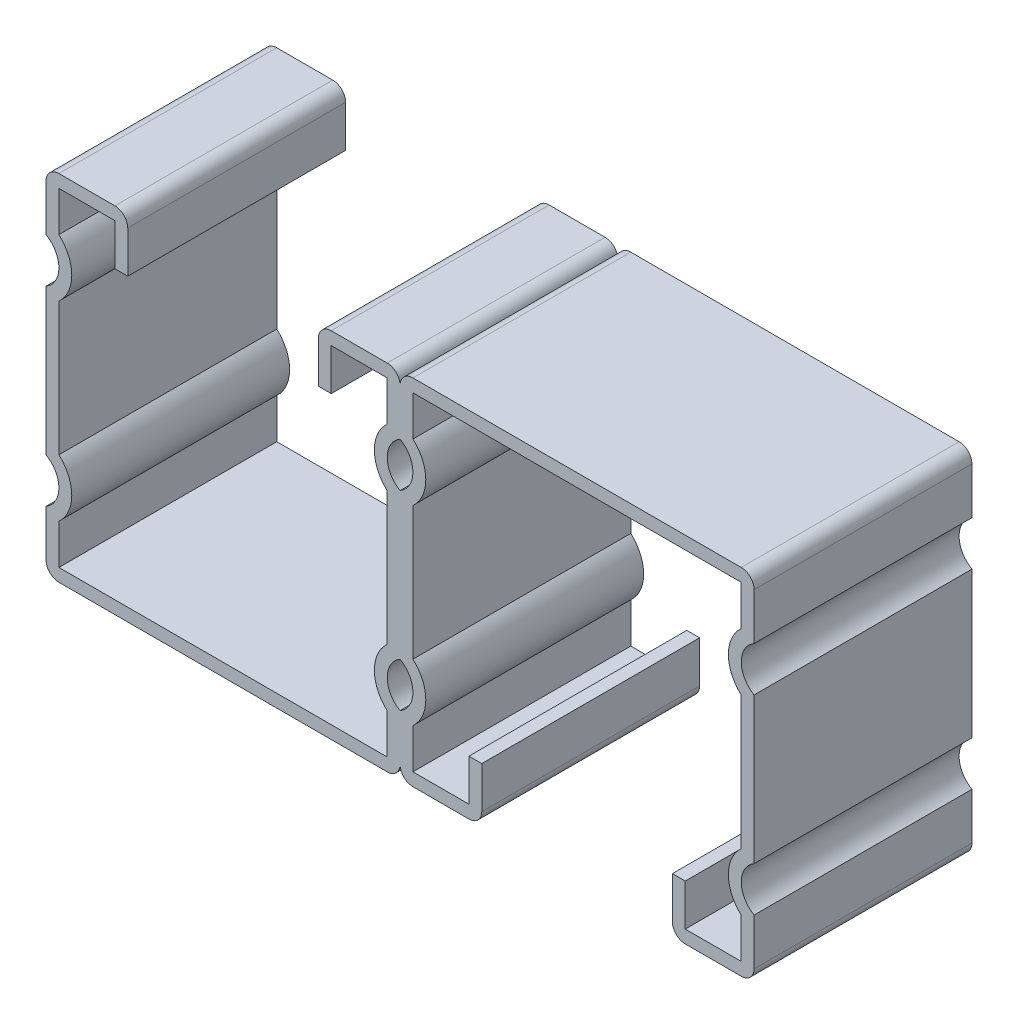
ISO-10303-21;
HEADER;
FILE_DESCRIPTION(('STEP AP214'),'2;1');
FILE_NAME('part.step','',(''),(''),'','','');
FILE_SCHEMA(('AUTOMOTIVE_DESIGN { 1 0 10303 214 1 1 1 1 }'));
ENDSEC;
DATA;
#1=APPLICATION_CONTEXT('core data for automotive mechanical design processes');
#2=APPLICATION_PROTOCOL_DEFINITION('international standard','automotive_design',2000,#1);
#3=PRODUCT_CONTEXT('',#1,'mechanical');
#4=PRODUCT('Part','Part','',(#3));
#5=PRODUCT_RELATED_PRODUCT_CATEGORY('part','',(#4));
#6=PRODUCT_DEFINITION_FORMATION('','',#4);
#7=PRODUCT_DEFINITION_CONTEXT('part definition',#1,'design');
#8=PRODUCT_DEFINITION('design','',#6,#7);
#9=PRODUCT_DEFINITION_SHAPE('','',#8);
#10=(LENGTH_UNIT() NAMED_UNIT(*) SI_UNIT(.MILLI.,.METRE.));
#11=(NAMED_UNIT(*) PLANE_ANGLE_UNIT() SI_UNIT($,.RADIAN.));
#12=(NAMED_UNIT(*) SI_UNIT($,.STERADIAN.) SOLID_ANGLE_UNIT());
#13=UNCERTAINTY_MEASURE_WITH_UNIT(LENGTH_MEASURE(1.E-05),#10,'distance_accuracy_value','');
#14=(GEOMETRIC_REPRESENTATION_CONTEXT(3) GLOBAL_UNCERTAINTY_ASSIGNED_CONTEXT((#13)) GLOBAL_UNIT_ASSIGNED_CONTEXT((#10,
#11,#12)) REPRESENTATION_CONTEXT('',''));
#15=CARTESIAN_POINT('',(0.,0.,0.));
#16=DIRECTION('',(0.,0.,1.));
#17=DIRECTION('',(1.,0.,0.));
#18=AXIS2_PLACEMENT_3D('',#15,#16,#17);
#19=CARTESIAN_POINT('',(-39.7764,19.1389,12.7));
#20=DIRECTION('',(-1.,0.,0.));
#21=DIRECTION('',(0.,0.,1.));
#22=AXIS2_PLACEMENT_3D('',#19,#20,#21);
#23=PLANE('',#22);
#24=DIRECTION('',(0.,1.,0.));
#25=VECTOR('',#24,1.);
#26=CARTESIAN_POINT('',(-39.7764,19.1389,-12.7));
#27=LINE('',#26,#25);
#28=CARTESIAN_POINT('',(-39.7764,14.4634714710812,-12.7));
#29=VERTEX_POINT('',#28);
#30=CARTESIAN_POINT('',(-39.7764,19.1389,-12.7));
#31=VERTEX_POINT('',#30);
#32=EDGE_CURVE('E306',#29,#31,#27,.T.);
#33=ORIENTED_EDGE('',*,*,#32,.T.);
#34=DIRECTION('',(0.,0.,-1.));
#35=VECTOR('',#34,1.);
#36=CARTESIAN_POINT('',(-39.7764,19.1389,12.7));
#37=LINE('',#36,#35);
#38=CARTESIAN_POINT('',(-39.7764,19.1389,12.7));
#39=VERTEX_POINT('',#38);
#40=EDGE_CURVE('E11',#39,#31,#37,.T.);
#41=ORIENTED_EDGE('',*,*,#40,.F.);
#42=DIRECTION('',(0.,1.,0.));
#43=VECTOR('',#42,1.);
#44=CARTESIAN_POINT('',(-39.7764,19.1389,12.7));
#45=LINE('',#44,#43);
#46=CARTESIAN_POINT('',(-39.7764,14.4634714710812,12.7));
#47=VERTEX_POINT('',#46);
#48=EDGE_CURVE('E375',#47,#39,#45,.T.);
#49=ORIENTED_EDGE('',*,*,#48,.F.);
#50=DIRECTION('',(0.,0.,-1.));
#51=VECTOR('',#50,1.);
#52=CARTESIAN_POINT('',(-39.7764,14.4634714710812,12.7));
#53=LINE('',#52,#51);
#54=EDGE_CURVE('E302',#47,#29,#53,.T.);
#55=ORIENTED_EDGE('',*,*,#54,.T.);
#56=EDGE_LOOP('',(#33,#41,#49,#55));
#57=FACE_BOUND('',#56,.T.);
#58=ADVANCED_FACE('F33',(#57),#23,.F.);
#59=CARTESIAN_POINT('',(-39.7764,19.1389,12.7));
#60=DIRECTION('',(0.,1.,0.));
#61=DIRECTION('',(-1.,0.,0.));
#62=AXIS2_PLACEMENT_3D('',#59,#60,#61);
#63=PLANE('',#62);
#64=DIRECTION('',(1.,0.,0.));
#65=VECTOR('',#64,1.);
#66=CARTESIAN_POINT('',(-39.7764,19.1389,-12.7));
#67=LINE('',#66,#65);
#68=CARTESIAN_POINT('',(-33.2486,19.1389,-12.7));
#69=VERTEX_POINT('',#68);
#70=EDGE_CURVE('E309',#31,#69,#67,.T.);
#71=ORIENTED_EDGE('',*,*,#70,.T.);
#72=DIRECTION('',(0.,0.,-1.));
#73=VECTOR('',#72,1.);
#74=CARTESIAN_POINT('',(-33.2486,19.1389,12.7));
#75=LINE('',#74,#73);
#76=CARTESIAN_POINT('',(-33.2486,19.1389,12.7));
#77=VERTEX_POINT('',#76);
#78=EDGE_CURVE('E41',#77,#69,#75,.T.);
#79=ORIENTED_EDGE('',*,*,#78,.F.);
#80=DIRECTION('',(1.,0.,0.));
#81=VECTOR('',#80,1.);
#82=CARTESIAN_POINT('',(-39.7764,19.1389,12.7));
#83=LINE('',#82,#81);
#84=EDGE_CURVE('E174',#39,#77,#83,.T.);
#85=ORIENTED_EDGE('',*,*,#84,.F.);
#86=ORIENTED_EDGE('',*,*,#40,.T.);
#87=EDGE_LOOP('',(#71,#79,#85,#86));
#88=FACE_BOUND('',#87,.T.);
#89=ADVANCED_FACE('F579',(#88),#63,.F.);
#90=CARTESIAN_POINT('',(-33.2486,19.1389,12.7));
#91=DIRECTION('',(1.,0.,0.));
#92=DIRECTION('',(0.,0.,-1.));
#93=AXIS2_PLACEMENT_3D('',#90,#91,#92);
#94=PLANE('',#93);
#95=DIRECTION('',(0.,-1.,0.));
#96=VECTOR('',#95,1.);
#97=CARTESIAN_POINT('',(-33.2486,19.1389,-12.7));
#98=LINE('',#97,#96);
#99=CARTESIAN_POINT('',(-33.2486,14.2875,-12.7));
#100=VERTEX_POINT('',#99);
#101=EDGE_CURVE('E312',#69,#100,#98,.T.);
#102=ORIENTED_EDGE('',*,*,#101,.T.);
#103=DIRECTION('',(0.,0.,-1.));
#104=VECTOR('',#103,1.);
#105=CARTESIAN_POINT('',(-33.2486,14.2875,12.7));
#106=LINE('',#105,#104);
#107=CARTESIAN_POINT('',(-33.2486,14.2875,12.7));
#108=VERTEX_POINT('',#107);
#109=EDGE_CURVE('E472',#108,#100,#106,.T.);
#110=ORIENTED_EDGE('',*,*,#109,.F.);
#111=DIRECTION('',(0.,-1.,0.));
#112=VECTOR('',#111,1.);
#113=CARTESIAN_POINT('',(-33.2486,19.1389,12.7));
#114=LINE('',#113,#112);
#115=EDGE_CURVE('E480',#77,#108,#114,.T.);
#116=ORIENTED_EDGE('',*,*,#115,.F.);
#117=ORIENTED_EDGE('',*,*,#78,.T.);
#118=EDGE_LOOP('',(#102,#110,#116,#117));
#119=FACE_BOUND('',#118,.T.);
#120=ADVANCED_FACE('F478',(#119),#94,.F.);
#121=CARTESIAN_POINT('',(-33.2486,14.2875,12.7));
#122=DIRECTION('',(0.,1.,0.));
#123=DIRECTION('',(-1.,0.,0.));
#124=AXIS2_PLACEMENT_3D('',#121,#122,#123);
#125=PLANE('',#124);
#126=DIRECTION('',(1.,0.,0.));
#127=VECTOR('',#126,1.);
#128=CARTESIAN_POINT('',(-33.2486,14.2875,-12.7));
#129=LINE('',#128,#127);
#130=CARTESIAN_POINT('',(-31.75,14.2875,-12.7));
#131=VERTEX_POINT('',#130);
#132=EDGE_CURVE('E314',#100,#131,#129,.T.);
#133=ORIENTED_EDGE('',*,*,#132,.T.);
#134=DIRECTION('',(0.,0.,-1.));
#135=VECTOR('',#134,1.);
#136=CARTESIAN_POINT('',(-31.75,14.2875,12.7));
#137=LINE('',#136,#135);
#138=CARTESIAN_POINT('',(-31.75,14.2875,12.7));
#139=VERTEX_POINT('',#138);
#140=EDGE_CURVE('E469',#139,#131,#137,.T.);
#141=ORIENTED_EDGE('',*,*,#140,.F.);
#142=DIRECTION('',(1.,0.,0.));
#143=VECTOR('',#142,1.);
#144=CARTESIAN_POINT('',(-33.2486,14.2875,12.7));
#145=LINE('',#144,#143);
#146=EDGE_CURVE('E500',#108,#139,#145,.T.);
#147=ORIENTED_EDGE('',*,*,#146,.F.);
#148=ORIENTED_EDGE('',*,*,#109,.T.);
#149=EDGE_LOOP('',(#133,#141,#147,#148));
#150=FACE_BOUND('',#149,.T.);
#151=ADVANCED_FACE('F491',(#150),#125,.F.);
#152=CARTESIAN_POINT('',(-31.75,19.1389,12.7));
#153=DIRECTION('',(-1.,0.,0.));
#154=DIRECTION('',(0.,-1.,0.));
#155=AXIS2_PLACEMENT_3D('',#152,#153,#154);
#156=PLANE('',#155);
#157=DIRECTION('',(0.,1.,0.));
#158=VECTOR('',#157,1.);
#159=CARTESIAN_POINT('',(-31.75,19.1389,-12.7));
#160=LINE('',#159,#158);
#161=CARTESIAN_POINT('',(-31.75,19.1389,-12.7));
#162=VERTEX_POINT('',#161);
#163=EDGE_CURVE('E316',#131,#162,#160,.T.);
#164=ORIENTED_EDGE('',*,*,#163,.T.);
#165=DIRECTION('',(0.,0.,-1.));
#166=VECTOR('',#165,1.);
#167=CARTESIAN_POINT('',(-31.75,19.1389,12.7));
#168=LINE('',#167,#166);
#169=CARTESIAN_POINT('',(-31.75,19.1389,12.7));
#170=VERTEX_POINT('',#169);
#171=EDGE_CURVE('E466',#170,#162,#168,.T.);
#172=ORIENTED_EDGE('',*,*,#171,.F.);
#173=DIRECTION('',(0.,1.,0.));
#174=VECTOR('',#173,1.);
#175=CARTESIAN_POINT('',(-31.75,19.1389,12.7));
#176=LINE('',#175,#174);
#177=EDGE_CURVE('E497',#139,#170,#176,.T.);
#178=ORIENTED_EDGE('',*,*,#177,.F.);
#179=ORIENTED_EDGE('',*,*,#140,.T.);
#180=EDGE_LOOP('',(#164,#172,#178,#179));
#181=FACE_BOUND('',#180,.T.);
#182=ADVANCED_FACE('F495',(#181),#156,.F.);
#183=CARTESIAN_POINT('',(-33.2486,19.1389,12.7));
#184=DIRECTION('',(0.,0.,-1.));
#185=DIRECTION('',(-1.,0.,0.));
#186=AXIS2_PLACEMENT_3D('',#183,#184,#185);
#187=CYLINDRICAL_SURFACE('',#186,1.49860000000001);
#188=CARTESIAN_POINT('',(-33.2486,19.1389,-12.7));
#189=DIRECTION('',(0.,0.,1.));
#190=DIRECTION('',(-1.,0.,0.));
#191=AXIS2_PLACEMENT_3D('',#188,#189,#190);
#192=CIRCLE('',#191,1.49860000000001);
#193=CARTESIAN_POINT('',(-33.2486,20.6375,-12.7));
#194=VERTEX_POINT('',#193);
#195=EDGE_CURVE('E318',#162,#194,#192,.T.);
#196=ORIENTED_EDGE('',*,*,#195,.T.);
#197=DIRECTION('',(0.,0.,-1.));
#198=VECTOR('',#197,1.);
#199=CARTESIAN_POINT('',(-33.2486,20.6375,12.7));
#200=LINE('',#199,#198);
#201=CARTESIAN_POINT('',(-33.2486,20.6375,12.7));
#202=VERTEX_POINT('',#201);
#203=EDGE_CURVE('E463',#202,#194,#200,.T.);
#204=ORIENTED_EDGE('',*,*,#203,.F.);
#205=CARTESIAN_POINT('',(-33.2486,19.1389,12.7));
#206=DIRECTION('',(0.,0.,1.));
#207=DIRECTION('',(-1.,0.,0.));
#208=AXIS2_PLACEMENT_3D('',#205,#206,#207);
#209=CIRCLE('',#208,1.49860000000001);
#210=EDGE_CURVE('E499',#170,#202,#209,.T.);
#211=ORIENTED_EDGE('',*,*,#210,.F.);
#212=ORIENTED_EDGE('',*,*,#171,.T.);
#213=EDGE_LOOP('',(#196,#204,#211,#212));
#214=FACE_BOUND('',#213,.T.);
#215=ADVANCED_FACE('F592',(#214),#187,.T.);
#216=CARTESIAN_POINT('',(-39.7764,20.6375,12.7));
#217=DIRECTION('',(0.,-1.,0.));
#218=DIRECTION('',(0.,0.,-1.));
#219=AXIS2_PLACEMENT_3D('',#216,#217,#218);
#220=PLANE('',#219);
#221=DIRECTION('',(-1.,0.,0.));
#222=VECTOR('',#221,1.);
#223=CARTESIAN_POINT('',(-39.7764,20.6375,-12.7));
#224=LINE('',#223,#222);
#225=CARTESIAN_POINT('',(-39.7764,20.6375,-12.7));
#226=VERTEX_POINT('',#225);
#227=EDGE_CURVE('E320',#194,#226,#224,.T.);
#228=ORIENTED_EDGE('',*,*,#227,.T.);
#229=DIRECTION('',(0.,0.,-1.));
#230=VECTOR('',#229,1.);
#231=CARTESIAN_POINT('',(-39.7764,20.6375,12.7));
#232=LINE('',#231,#230);
#233=CARTESIAN_POINT('',(-39.7764,20.6375,12.7));
#234=VERTEX_POINT('',#233);
#235=EDGE_CURVE('E460',#234,#226,#232,.T.);
#236=ORIENTED_EDGE('',*,*,#235,.F.);
#237=DIRECTION('',(-1.,0.,0.));
#238=VECTOR('',#237,1.);
#239=CARTESIAN_POINT('',(-39.7764,20.6375,12.7));
#240=LINE('',#239,#238);
#241=EDGE_CURVE('E502',#202,#234,#240,.T.);
#242=ORIENTED_EDGE('',*,*,#241,.F.);
#243=ORIENTED_EDGE('',*,*,#203,.T.);
#244=EDGE_LOOP('',(#228,#236,#242,#243));
#245=FACE_BOUND('',#244,.T.);
#246=ADVANCED_FACE('F595',(#245),#220,.F.);
#247=CARTESIAN_POINT('',(-39.7764,19.1389,12.7));
#248=DIRECTION('',(0.,0.,-1.));
#249=DIRECTION('',(-1.,0.,0.));
#250=AXIS2_PLACEMENT_3D('',#247,#248,#249);
#251=CYLINDRICAL_SURFACE('',#250,1.49860000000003);
#252=CARTESIAN_POINT('',(-39.7764,19.1389,-12.7));
#253=DIRECTION('',(0.,0.,1.));
#254=DIRECTION('',(-1.,0.,0.));
#255=AXIS2_PLACEMENT_3D('',#252,#253,#254);
#256=CIRCLE('',#255,1.49860000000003);
#257=CARTESIAN_POINT('',(-41.275,19.1389,-12.7));
#258=VERTEX_POINT('',#257);
#259=EDGE_CURVE('E322',#226,#258,#256,.T.);
#260=ORIENTED_EDGE('',*,*,#259,.T.);
#261=DIRECTION('',(0.,0.,-1.));
#262=VECTOR('',#261,1.);
#263=CARTESIAN_POINT('',(-41.275,19.1389,12.7));
#264=LINE('',#263,#262);
#265=CARTESIAN_POINT('',(-41.275,19.1389,12.7));
#266=VERTEX_POINT('',#265);
#267=EDGE_CURVE('E457',#266,#258,#264,.T.);
#268=ORIENTED_EDGE('',*,*,#267,.F.);
#269=CARTESIAN_POINT('',(-39.7764,19.1389,12.7));
#270=DIRECTION('',(0.,0.,1.));
#271=DIRECTION('',(-1.,0.,0.));
#272=AXIS2_PLACEMENT_3D('',#269,#270,#271);
#273=CIRCLE('',#272,1.49860000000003);
#274=EDGE_CURVE('E508',#234,#266,#273,.T.);
#275=ORIENTED_EDGE('',*,*,#274,.F.);
#276=ORIENTED_EDGE('',*,*,#235,.T.);
#277=EDGE_LOOP('',(#260,#268,#275,#276));
#278=FACE_BOUND('',#277,.T.);
#279=ADVANCED_FACE('F599',(#278),#251,.T.);
#280=CARTESIAN_POINT('',(-41.275,19.1389,12.7));
#281=DIRECTION('',(1.,0.,0.));
#282=DIRECTION('',(0.,1.,0.));
#283=AXIS2_PLACEMENT_3D('',#280,#281,#282);
#284=PLANE('',#283);
#285=DIRECTION('',(0.,-1.,0.));
#286=VECTOR('',#285,1.);
#287=CARTESIAN_POINT('',(-41.275,19.1389,-12.7));
#288=LINE('',#287,#286);
#289=CARTESIAN_POINT('',(-41.275,13.7081513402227,-12.7));
#290=VERTEX_POINT('',#289);
#291=EDGE_CURVE('E324',#258,#290,#288,.T.);
#292=ORIENTED_EDGE('',*,*,#291,.T.);
#293=DIRECTION('',(0.,0.,-1.));
#294=VECTOR('',#293,1.);
#295=CARTESIAN_POINT('',(-41.275,13.7081513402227,12.7));
#296=LINE('',#295,#294);
#297=CARTESIAN_POINT('',(-41.275,13.7081513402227,12.7));
#298=VERTEX_POINT('',#297);
#299=EDGE_CURVE('E454',#298,#290,#296,.T.);
#300=ORIENTED_EDGE('',*,*,#299,.F.);
#301=DIRECTION('',(0.,-1.,0.));
#302=VECTOR('',#301,1.);
#303=CARTESIAN_POINT('',(-41.275,19.1389,12.7));
#304=LINE('',#303,#302);
#305=EDGE_CURVE('E510',#266,#298,#304,.T.);
#306=ORIENTED_EDGE('',*,*,#305,.F.);
#307=ORIENTED_EDGE('',*,*,#267,.T.);
#308=EDGE_LOOP('',(#292,#300,#306,#307));
#309=FACE_BOUND('',#308,.T.);
#310=ADVANCED_FACE('F603',(#309),#284,.F.);
#311=CARTESIAN_POINT('',(-42.7736,11.1125,12.7));
#312=DIRECTION('',(0.,0.,-1.));
#313=DIRECTION('',(-1.,0.,0.));
#314=AXIS2_PLACEMENT_3D('',#311,#312,#313);
#315=CYLINDRICAL_SURFACE('',#314,2.9972);
#316=CARTESIAN_POINT('',(-42.7736,11.1125,-12.7));
#317=DIRECTION('',(0.,0.,-1.));
#318=DIRECTION('',(1.,0.,0.));
#319=AXIS2_PLACEMENT_3D('',#316,#317,#318);
#320=CIRCLE('',#319,2.9972);
#321=CARTESIAN_POINT('',(-41.275,8.51684865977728,-12.7));
#322=VERTEX_POINT('',#321);
#323=EDGE_CURVE('E326',#290,#322,#320,.T.);
#324=ORIENTED_EDGE('',*,*,#323,.T.);
#325=DIRECTION('',(0.,0.,-1.));
#326=VECTOR('',#325,1.);
#327=CARTESIAN_POINT('',(-41.275,8.51684865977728,12.7));
#328=LINE('',#327,#326);
#329=CARTESIAN_POINT('',(-41.275,8.51684865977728,12.7));
#330=VERTEX_POINT('',#329);
#331=EDGE_CURVE('E451',#330,#322,#328,.T.);
#332=ORIENTED_EDGE('',*,*,#331,.F.);
#333=CARTESIAN_POINT('',(-42.7736,11.1125,12.7));
#334=DIRECTION('',(0.,0.,-1.));
#335=DIRECTION('',(1.,0.,0.));
#336=AXIS2_PLACEMENT_3D('',#333,#334,#335);
#337=CIRCLE('',#336,2.9972);
#338=EDGE_CURVE('E512',#298,#330,#337,.T.);
#339=ORIENTED_EDGE('',*,*,#338,.F.);
#340=ORIENTED_EDGE('',*,*,#299,.T.);
#341=EDGE_LOOP('',(#324,#332,#339,#340));
#342=FACE_BOUND('',#341,.T.);
#343=ADVANCED_FACE('F607',(#342),#315,.F.);
#344=CARTESIAN_POINT('',(-41.275,8.51684865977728,12.7));
#345=DIRECTION('',(1.,0.,0.));
#346=DIRECTION('',(0.,0.,-1.));
#347=AXIS2_PLACEMENT_3D('',#344,#345,#346);
#348=PLANE('',#347);
#349=DIRECTION('',(0.,-1.,0.));
#350=VECTOR('',#349,1.);
#351=CARTESIAN_POINT('',(-41.275,8.51684865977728,-12.7));
#352=LINE('',#351,#350);
#353=CARTESIAN_POINT('',(-41.275,-8.51684865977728,-12.7));
#354=VERTEX_POINT('',#353);
#355=EDGE_CURVE('E328',#322,#354,#352,.T.);
#356=ORIENTED_EDGE('',*,*,#355,.T.);
#357=DIRECTION('',(0.,0.,-1.));
#358=VECTOR('',#357,1.);
#359=CARTESIAN_POINT('',(-41.275,-8.51684865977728,12.7));
#360=LINE('',#359,#358);
#361=CARTESIAN_POINT('',(-41.275,-8.51684865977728,12.7));
#362=VERTEX_POINT('',#361);
#363=EDGE_CURVE('E448',#362,#354,#360,.T.);
#364=ORIENTED_EDGE('',*,*,#363,.F.);
#365=DIRECTION('',(0.,-1.,0.));
#366=VECTOR('',#365,1.);
#367=CARTESIAN_POINT('',(-41.275,8.51684865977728,12.7));
#368=LINE('',#367,#366);
#369=EDGE_CURVE('E514',#330,#362,#368,.T.);
#370=ORIENTED_EDGE('',*,*,#369,.F.);
#371=ORIENTED_EDGE('',*,*,#331,.T.);
#372=EDGE_LOOP('',(#356,#364,#370,#371));
#373=FACE_BOUND('',#372,.T.);
#374=ADVANCED_FACE('F611',(#373),#348,.F.);
#375=CARTESIAN_POINT('',(-42.7736,-11.1125,12.7));
#376=DIRECTION('',(0.,0.,-1.));
#377=DIRECTION('',(-1.,0.,0.));
#378=AXIS2_PLACEMENT_3D('',#375,#376,#377);
#379=CYLINDRICAL_SURFACE('',#378,2.9972);
#380=CARTESIAN_POINT('',(-42.7736,-11.1125,-12.7));
#381=DIRECTION('',(0.,0.,-1.));
#382=DIRECTION('',(-1.,0.,0.));
#383=AXIS2_PLACEMENT_3D('',#380,#381,#382);
#384=CIRCLE('',#383,2.9972);
#385=CARTESIAN_POINT('',(-41.275,-13.7081513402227,-12.7));
#386=VERTEX_POINT('',#385);
#387=EDGE_CURVE('E330',#354,#386,#384,.T.);
#388=ORIENTED_EDGE('',*,*,#387,.T.);
#389=DIRECTION('',(0.,0.,-1.));
#390=VECTOR('',#389,1.);
#391=CARTESIAN_POINT('',(-41.275,-13.7081513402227,12.7));
#392=LINE('',#391,#390);
#393=CARTESIAN_POINT('',(-41.275,-13.7081513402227,12.7));
#394=VERTEX_POINT('',#393);
#395=EDGE_CURVE('E445',#394,#386,#392,.T.);
#396=ORIENTED_EDGE('',*,*,#395,.F.);
#397=CARTESIAN_POINT('',(-42.7736,-11.1125,12.7));
#398=DIRECTION('',(0.,0.,-1.));
#399=DIRECTION('',(-1.,0.,0.));
#400=AXIS2_PLACEMENT_3D('',#397,#398,#399);
#401=CIRCLE('',#400,2.9972);
#402=EDGE_CURVE('E516',#362,#394,#401,.T.);
#403=ORIENTED_EDGE('',*,*,#402,.F.);
#404=ORIENTED_EDGE('',*,*,#363,.T.);
#405=EDGE_LOOP('',(#388,#396,#403,#404));
#406=FACE_BOUND('',#405,.T.);
#407=ADVANCED_FACE('F615',(#406),#379,.F.);
#408=CARTESIAN_POINT('',(-41.275,-13.7081513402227,12.7));
#409=DIRECTION('',(1.,0.,0.));
#410=DIRECTION('',(0.,1.,0.));
#411=AXIS2_PLACEMENT_3D('',#408,#409,#410);
#412=PLANE('',#411);
#413=DIRECTION('',(0.,-1.,0.));
#414=VECTOR('',#413,1.);
#415=CARTESIAN_POINT('',(-41.275,-13.7081513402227,-12.7));
#416=LINE('',#415,#414);
#417=CARTESIAN_POINT('',(-41.275,-19.1389,-12.7));
#418=VERTEX_POINT('',#417);
#419=EDGE_CURVE('E332',#386,#418,#416,.T.);
#420=ORIENTED_EDGE('',*,*,#419,.T.);
#421=DIRECTION('',(0.,0.,-1.));
#422=VECTOR('',#421,1.);
#423=CARTESIAN_POINT('',(-41.275,-19.1389,12.7));
#424=LINE('',#423,#422);
#425=CARTESIAN_POINT('',(-41.275,-19.1389,12.7));
#426=VERTEX_POINT('',#425);
#427=EDGE_CURVE('E442',#426,#418,#424,.T.);
#428=ORIENTED_EDGE('',*,*,#427,.F.);
#429=DIRECTION('',(0.,-1.,0.));
#430=VECTOR('',#429,1.);
#431=CARTESIAN_POINT('',(-41.275,-13.7081513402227,12.7));
#432=LINE('',#431,#430);
#433=EDGE_CURVE('E518',#394,#426,#432,.T.);
#434=ORIENTED_EDGE('',*,*,#433,.F.);
#435=ORIENTED_EDGE('',*,*,#395,.T.);
#436=EDGE_LOOP('',(#420,#428,#434,#435));
#437=FACE_BOUND('',#436,.T.);
#438=ADVANCED_FACE('F619',(#437),#412,.F.);
#439=CARTESIAN_POINT('',(-39.7764,-19.1389,12.7));
#440=DIRECTION('',(0.,0.,-1.));
#441=DIRECTION('',(-1.,0.,0.));
#442=AXIS2_PLACEMENT_3D('',#439,#440,#441);
#443=CYLINDRICAL_SURFACE('',#442,1.4986);
#444=CARTESIAN_POINT('',(-39.7764,-19.1389,-12.7));
#445=DIRECTION('',(0.,0.,1.));
#446=DIRECTION('',(-1.,0.,0.));
#447=AXIS2_PLACEMENT_3D('',#444,#445,#446);
#448=CIRCLE('',#447,1.4986);
#449=CARTESIAN_POINT('',(-39.7764,-20.6375,-12.7));
#450=VERTEX_POINT('',#449);
#451=EDGE_CURVE('E334',#418,#450,#448,.T.);
#452=ORIENTED_EDGE('',*,*,#451,.T.);
#453=DIRECTION('',(0.,0.,-1.));
#454=VECTOR('',#453,1.);
#455=CARTESIAN_POINT('',(-39.7764,-20.6375,12.7));
#456=LINE('',#455,#454);
#457=CARTESIAN_POINT('',(-39.7764,-20.6375,12.7));
#458=VERTEX_POINT('',#457);
#459=EDGE_CURVE('E439',#458,#450,#456,.T.);
#460=ORIENTED_EDGE('',*,*,#459,.F.);
#461=CARTESIAN_POINT('',(-39.7764,-19.1389,12.7));
#462=DIRECTION('',(0.,0.,1.));
#463=DIRECTION('',(-1.,0.,0.));
#464=AXIS2_PLACEMENT_3D('',#461,#462,#463);
#465=CIRCLE('',#464,1.4986);
#466=EDGE_CURVE('E520',#426,#458,#465,.T.);
#467=ORIENTED_EDGE('',*,*,#466,.F.);
#468=ORIENTED_EDGE('',*,*,#427,.T.);
#469=EDGE_LOOP('',(#452,#460,#467,#468));
#470=FACE_BOUND('',#469,.T.);
#471=ADVANCED_FACE('F623',(#470),#443,.T.);
#472=CARTESIAN_POINT('',(-39.7764,-20.6375,12.7));
#473=DIRECTION('',(0.,1.,0.));
#474=DIRECTION('',(0.,0.,1.));
#475=AXIS2_PLACEMENT_3D('',#472,#473,#474);
#476=PLANE('',#475);
#477=DIRECTION('',(1.,0.,0.));
#478=VECTOR('',#477,1.);
#479=CARTESIAN_POINT('',(-39.7764,-20.6375,-12.7));
#480=LINE('',#479,#478);
#481=CARTESIAN_POINT('',(-1.4986,-20.6375,-12.7));
#482=VERTEX_POINT('',#481);
#483=EDGE_CURVE('E336',#450,#482,#480,.T.);
#484=ORIENTED_EDGE('',*,*,#483,.T.);
#485=DIRECTION('',(0.,0.,-1.));
#486=VECTOR('',#485,1.);
#487=CARTESIAN_POINT('',(-1.4986,-20.6375,12.7));
#488=LINE('',#487,#486);
#489=CARTESIAN_POINT('',(-1.4986,-20.6375,12.7));
#490=VERTEX_POINT('',#489);
#491=EDGE_CURVE('E436',#490,#482,#488,.T.);
#492=ORIENTED_EDGE('',*,*,#491,.F.);
#493=DIRECTION('',(1.,0.,0.));
#494=VECTOR('',#493,1.);
#495=CARTESIAN_POINT('',(-39.7764,-20.6375,12.7));
#496=LINE('',#495,#494);
#497=EDGE_CURVE('E522',#458,#490,#496,.T.);
#498=ORIENTED_EDGE('',*,*,#497,.F.);
#499=ORIENTED_EDGE('',*,*,#459,.T.);
#500=EDGE_LOOP('',(#484,#492,#498,#499));
#501=FACE_BOUND('',#500,.T.);
#502=ADVANCED_FACE('F627',(#501),#476,.F.);
#503=CARTESIAN_POINT('',(-1.4986,-19.1389,12.7));
#504=DIRECTION('',(0.,0.,-1.));
#505=DIRECTION('',(-1.,0.,0.));
#506=AXIS2_PLACEMENT_3D('',#503,#504,#505);
#507=CYLINDRICAL_SURFACE('',#506,1.4986);
#508=CARTESIAN_POINT('',(-1.4986,-19.1389,-12.7));
#509=DIRECTION('',(0.,0.,1.));
#510=DIRECTION('',(-1.,0.,0.));
#511=AXIS2_PLACEMENT_3D('',#508,#509,#510);
#512=CIRCLE('',#511,1.4986);
#513=CARTESIAN_POINT('',(0.,-19.1389,-12.7));
#514=VERTEX_POINT('',#513);
#515=EDGE_CURVE('E338',#482,#514,#512,.T.);
#516=ORIENTED_EDGE('',*,*,#515,.T.);
#517=DIRECTION('',(0.,0.,-1.));
#518=VECTOR('',#517,1.);
#519=CARTESIAN_POINT('',(0.,-19.1389,12.7));
#520=LINE('',#519,#518);
#521=CARTESIAN_POINT('',(0.,-19.1389,12.7));
#522=VERTEX_POINT('',#521);
#523=EDGE_CURVE('E433',#522,#514,#520,.T.);
#524=ORIENTED_EDGE('',*,*,#523,.F.);
#525=CARTESIAN_POINT('',(-1.4986,-19.1389,12.7));
#526=DIRECTION('',(0.,0.,1.));
#527=DIRECTION('',(-1.,0.,0.));
#528=AXIS2_PLACEMENT_3D('',#525,#526,#527);
#529=CIRCLE('',#528,1.4986);
#530=EDGE_CURVE('E524',#490,#522,#529,.T.);
#531=ORIENTED_EDGE('',*,*,#530,.F.);
#532=ORIENTED_EDGE('',*,*,#491,.T.);
#533=EDGE_LOOP('',(#516,#524,#531,#532));
#534=FACE_BOUND('',#533,.T.);
#535=ADVANCED_FACE('F631',(#534),#507,.T.);
#536=CARTESIAN_POINT('',(1.4986,-11.1125,12.7));
#537=DIRECTION('',(0.,0.,-1.));
#538=DIRECTION('',(-1.,0.,0.));
#539=AXIS2_PLACEMENT_3D('',#536,#537,#538);
#540=CYLINDRICAL_SURFACE('',#539,2.9972);
#541=CARTESIAN_POINT('',(1.4986,-11.1125,-12.7));
#542=DIRECTION('',(0.,0.,-1.));
#543=DIRECTION('',(-1.,0.,0.));
#544=AXIS2_PLACEMENT_3D('',#541,#542,#543);
#545=CIRCLE('',#544,2.9972);
#546=CARTESIAN_POINT('',(0.,-13.7081513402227,-12.7));
#547=VERTEX_POINT('',#546);
#548=CARTESIAN_POINT('',(0.,-8.51684865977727,-12.7));
#549=VERTEX_POINT('',#548);
#550=EDGE_CURVE('E340',#547,#549,#545,.T.);
#551=ORIENTED_EDGE('',*,*,#550,.T.);
#552=DIRECTION('',(0.,0.,-1.));
#553=VECTOR('',#552,1.);
#554=CARTESIAN_POINT('',(0.,-8.51684865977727,12.7));
#555=LINE('',#554,#553);
#556=CARTESIAN_POINT('',(0.,-8.51684865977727,12.7));
#557=VERTEX_POINT('',#556);
#558=EDGE_CURVE('E427',#557,#549,#555,.T.);
#559=ORIENTED_EDGE('',*,*,#558,.F.);
#560=CARTESIAN_POINT('',(1.4986,-11.1125,12.7));
#561=DIRECTION('',(0.,0.,-1.));
#562=DIRECTION('',(-1.,0.,0.));
#563=AXIS2_PLACEMENT_3D('',#560,#561,#562);
#564=CIRCLE('',#563,2.9972);
#565=CARTESIAN_POINT('',(0.,-13.7081513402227,12.7));
#566=VERTEX_POINT('',#565);
#567=EDGE_CURVE('E526',#566,#557,#564,.T.);
#568=ORIENTED_EDGE('',*,*,#567,.F.);
#569=DIRECTION('',(0.,0.,-1.));
#570=VECTOR('',#569,1.);
#571=CARTESIAN_POINT('',(0.,-13.7081513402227,12.7));
#572=LINE('',#571,#570);
#573=EDGE_CURVE('E430',#566,#547,#572,.T.);
#574=ORIENTED_EDGE('',*,*,#573,.T.);
#575=EDGE_LOOP('',(#551,#559,#568,#574));
#576=FACE_BOUND('',#575,.T.);
#577=ADVANCED_FACE('F635',(#576),#540,.F.);
#578=CARTESIAN_POINT('',(1.4986,11.1125,12.7));
#579=DIRECTION('',(0.,0.,-1.));
#580=DIRECTION('',(-1.,0.,0.));
#581=AXIS2_PLACEMENT_3D('',#578,#579,#580);
#582=CYLINDRICAL_SURFACE('',#581,2.9972);
#583=CARTESIAN_POINT('',(1.4986,11.1125,-12.7));
#584=DIRECTION('',(0.,0.,-1.));
#585=DIRECTION('',(1.,0.,0.));
#586=AXIS2_PLACEMENT_3D('',#583,#584,#585);
#587=CIRCLE('',#586,2.9972);
#588=CARTESIAN_POINT('',(0.,8.51684865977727,-12.7));
#589=VERTEX_POINT('',#588);
#590=CARTESIAN_POINT('',(0.,13.7081513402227,-12.7));
#591=VERTEX_POINT('',#590);
#592=EDGE_CURVE('E342',#589,#591,#587,.T.);
#593=ORIENTED_EDGE('',*,*,#592,.T.);
#594=DIRECTION('',(0.,0.,-1.));
#595=VECTOR('',#594,1.);
#596=CARTESIAN_POINT('',(0.,13.7081513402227,12.7));
#597=LINE('',#596,#595);
#598=CARTESIAN_POINT('',(0.,13.7081513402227,12.7));
#599=VERTEX_POINT('',#598);
#600=EDGE_CURVE('E421',#599,#591,#597,.T.);
#601=ORIENTED_EDGE('',*,*,#600,.F.);
#602=CARTESIAN_POINT('',(1.4986,11.1125,12.7));
#603=DIRECTION('',(0.,0.,-1.));
#604=DIRECTION('',(1.,0.,0.));
#605=AXIS2_PLACEMENT_3D('',#602,#603,#604);
#606=CIRCLE('',#605,2.9972);
#607=CARTESIAN_POINT('',(0.,8.51684865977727,12.7));
#608=VERTEX_POINT('',#607);
#609=EDGE_CURVE('E528',#608,#599,#606,.T.);
#610=ORIENTED_EDGE('',*,*,#609,.F.);
#611=DIRECTION('',(0.,0.,-1.));
#612=VECTOR('',#611,1.);
#613=CARTESIAN_POINT('',(0.,8.51684865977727,12.7));
#614=LINE('',#613,#612);
#615=EDGE_CURVE('E424',#608,#589,#614,.T.);
#616=ORIENTED_EDGE('',*,*,#615,.T.);
#617=EDGE_LOOP('',(#593,#601,#610,#616));
#618=FACE_BOUND('',#617,.T.);
#619=ADVANCED_FACE('F639',(#618),#582,.F.);
#620=CARTESIAN_POINT('',(-1.4986,19.1389,12.7));
#621=DIRECTION('',(0.,0.,-1.));
#622=DIRECTION('',(-1.,0.,0.));
#623=AXIS2_PLACEMENT_3D('',#620,#621,#622);
#624=CYLINDRICAL_SURFACE('',#623,1.4986);
#625=CARTESIAN_POINT('',(-1.4986,19.1389,-12.7));
#626=DIRECTION('',(0.,0.,1.));
#627=DIRECTION('',(-1.,0.,0.));
#628=AXIS2_PLACEMENT_3D('',#625,#626,#627);
#629=CIRCLE('',#628,1.4986);
#630=CARTESIAN_POINT('',(-1.31911500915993E-13,19.1389,-12.7));
#631=VERTEX_POINT('',#630);
#632=CARTESIAN_POINT('',(-1.4986,20.6375,-12.7));
#633=VERTEX_POINT('',#632);
#634=EDGE_CURVE('E344',#631,#633,#629,.T.);
#635=ORIENTED_EDGE('',*,*,#634,.T.);
#636=DIRECTION('',(0.,0.,-1.));
#637=VECTOR('',#636,1.);
#638=CARTESIAN_POINT('',(-1.4986,20.6375,12.7));
#639=LINE('',#638,#637);
#640=CARTESIAN_POINT('',(-1.4986,20.6375,12.7));
#641=VERTEX_POINT('',#640);
#642=EDGE_CURVE('E415',#641,#633,#639,.T.);
#643=ORIENTED_EDGE('',*,*,#642,.F.);
#644=CARTESIAN_POINT('',(-1.4986,19.1389,12.7));
#645=DIRECTION('',(0.,0.,1.));
#646=DIRECTION('',(-1.,0.,0.));
#647=AXIS2_PLACEMENT_3D('',#644,#645,#646);
#648=CIRCLE('',#647,1.4986);
#649=CARTESIAN_POINT('',(0.,19.1389,12.7));
#650=VERTEX_POINT('',#649);
#651=EDGE_CURVE('E530',#650,#641,#648,.T.);
#652=ORIENTED_EDGE('',*,*,#651,.F.);
#653=DIRECTION('',(0.,0.,-1.));
#654=VECTOR('',#653,1.);
#655=CARTESIAN_POINT('',(0.,19.1389,12.7));
#656=LINE('',#655,#654);
#657=EDGE_CURVE('E418',#650,#631,#656,.T.);
#658=ORIENTED_EDGE('',*,*,#657,.T.);
#659=EDGE_LOOP('',(#635,#643,#652,#658));
#660=FACE_BOUND('',#659,.T.);
#661=ADVANCED_FACE('F643',(#660),#624,.T.);
#662=CARTESIAN_POINT('',(-1.4986,20.6375,12.7));
#663=DIRECTION('',(0.,-1.,0.));
#664=DIRECTION('',(0.,0.,-1.));
#665=AXIS2_PLACEMENT_3D('',#662,#663,#664);
#666=PLANE('',#665);
#667=DIRECTION('',(-1.,0.,0.));
#668=VECTOR('',#667,1.);
#669=CARTESIAN_POINT('',(-1.4986,20.6375,-12.7));
#670=LINE('',#669,#668);
#671=CARTESIAN_POINT('',(-8.0264,20.6375,-12.7));
#672=VERTEX_POINT('',#671);
#673=EDGE_CURVE('E346',#633,#672,#670,.T.);
#674=ORIENTED_EDGE('',*,*,#673,.T.);
#675=DIRECTION('',(0.,0.,-1.));
#676=VECTOR('',#675,1.);
#677=CARTESIAN_POINT('',(-8.0264,20.6375,12.7));
#678=LINE('',#677,#676);
#679=CARTESIAN_POINT('',(-8.0264,20.6375,12.7));
#680=VERTEX_POINT('',#679);
#681=EDGE_CURVE('E412',#680,#672,#678,.T.);
#682=ORIENTED_EDGE('',*,*,#681,.F.);
#683=DIRECTION('',(-1.,0.,0.));
#684=VECTOR('',#683,1.);
#685=CARTESIAN_POINT('',(-1.4986,20.6375,12.7));
#686=LINE('',#685,#684);
#687=EDGE_CURVE('E532',#641,#680,#686,.T.);
#688=ORIENTED_EDGE('',*,*,#687,.F.);
#689=ORIENTED_EDGE('',*,*,#642,.T.);
#690=EDGE_LOOP('',(#674,#682,#688,#689));
#691=FACE_BOUND('',#690,.T.);
#692=ADVANCED_FACE('F647',(#691),#666,.F.);
#693=CARTESIAN_POINT('',(-8.0264,19.1389,12.7));
#694=DIRECTION('',(0.,0.,-1.));
#695=DIRECTION('',(-1.,0.,0.));
#696=AXIS2_PLACEMENT_3D('',#693,#694,#695);
#697=CYLINDRICAL_SURFACE('',#696,1.4986);
#698=CARTESIAN_POINT('',(-8.0264,19.1389,-12.7));
#699=DIRECTION('',(0.,0.,1.));
#700=DIRECTION('',(-1.,0.,0.));
#701=AXIS2_PLACEMENT_3D('',#698,#699,#700);
#702=CIRCLE('',#701,1.4986);
#703=CARTESIAN_POINT('',(-9.525,19.1389,-12.7));
#704=VERTEX_POINT('',#703);
#705=EDGE_CURVE('E348',#672,#704,#702,.T.);
#706=ORIENTED_EDGE('',*,*,#705,.T.);
#707=DIRECTION('',(0.,0.,-1.));
#708=VECTOR('',#707,1.);
#709=CARTESIAN_POINT('',(-9.525,19.1389,12.7));
#710=LINE('',#709,#708);
#711=CARTESIAN_POINT('',(-9.525,19.1389,12.7));
#712=VERTEX_POINT('',#711);
#713=EDGE_CURVE('E409',#712,#704,#710,.T.);
#714=ORIENTED_EDGE('',*,*,#713,.F.);
#715=CARTESIAN_POINT('',(-8.0264,19.1389,12.7));
#716=DIRECTION('',(0.,0.,1.));
#717=DIRECTION('',(-1.,0.,0.));
#718=AXIS2_PLACEMENT_3D('',#715,#716,#717);
#719=CIRCLE('',#718,1.4986);
#720=EDGE_CURVE('E534',#680,#712,#719,.T.);
#721=ORIENTED_EDGE('',*,*,#720,.F.);
#722=ORIENTED_EDGE('',*,*,#681,.T.);
#723=EDGE_LOOP('',(#706,#714,#721,#722));
#724=FACE_BOUND('',#723,.T.);
#725=ADVANCED_FACE('F651',(#724),#697,.T.);
#726=CARTESIAN_POINT('',(-9.525,19.1389,12.7));
#727=DIRECTION('',(1.,0.,0.));
#728=DIRECTION('',(0.,0.,-1.));
#729=AXIS2_PLACEMENT_3D('',#726,#727,#728);
#730=PLANE('',#729);
#731=DIRECTION('',(0.,-1.,0.));
#732=VECTOR('',#731,1.);
#733=CARTESIAN_POINT('',(-9.525,19.1389,-12.7));
#734=LINE('',#733,#732);
#735=CARTESIAN_POINT('',(-9.525,14.2875,-12.7));
#736=VERTEX_POINT('',#735);
#737=EDGE_CURVE('E350',#704,#736,#734,.T.);
#738=ORIENTED_EDGE('',*,*,#737,.T.);
#739=DIRECTION('',(0.,0.,-1.));
#740=VECTOR('',#739,1.);
#741=CARTESIAN_POINT('',(-9.525,14.2875,12.7));
#742=LINE('',#741,#740);
#743=CARTESIAN_POINT('',(-9.525,14.2875,12.7));
#744=VERTEX_POINT('',#743);
#745=EDGE_CURVE('E406',#744,#736,#742,.T.);
#746=ORIENTED_EDGE('',*,*,#745,.F.);
#747=DIRECTION('',(0.,-1.,0.));
#748=VECTOR('',#747,1.);
#749=CARTESIAN_POINT('',(-9.525,19.1389,12.7));
#750=LINE('',#749,#748);
#751=EDGE_CURVE('E536',#712,#744,#750,.T.);
#752=ORIENTED_EDGE('',*,*,#751,.F.);
#753=ORIENTED_EDGE('',*,*,#713,.T.);
#754=EDGE_LOOP('',(#738,#746,#752,#753));
#755=FACE_BOUND('',#754,.T.);
#756=ADVANCED_FACE('F655',(#755),#730,.F.);
#757=CARTESIAN_POINT('',(-9.525,14.2875,12.7));
#758=DIRECTION('',(0.,1.,0.));
#759=DIRECTION('',(-1.,0.,0.));
#760=AXIS2_PLACEMENT_3D('',#757,#758,#759);
#761=PLANE('',#760);
#762=DIRECTION('',(1.,0.,0.));
#763=VECTOR('',#762,1.);
#764=CARTESIAN_POINT('',(-9.525,14.2875,-12.7));
#765=LINE('',#764,#763);
#766=CARTESIAN_POINT('',(-8.0264,14.2875,-12.7));
#767=VERTEX_POINT('',#766);
#768=EDGE_CURVE('E352',#736,#767,#765,.T.);
#769=ORIENTED_EDGE('',*,*,#768,.T.);
#770=DIRECTION('',(0.,0.,-1.));
#771=VECTOR('',#770,1.);
#772=CARTESIAN_POINT('',(-8.0264,14.2875,12.7));
#773=LINE('',#772,#771);
#774=CARTESIAN_POINT('',(-8.0264,14.2875,12.7));
#775=VERTEX_POINT('',#774);
#776=EDGE_CURVE('E403',#775,#767,#773,.T.);
#777=ORIENTED_EDGE('',*,*,#776,.F.);
#778=DIRECTION('',(1.,0.,0.));
#779=VECTOR('',#778,1.);
#780=CARTESIAN_POINT('',(-9.525,14.2875,12.7));
#781=LINE('',#780,#779);
#782=EDGE_CURVE('E538',#744,#775,#781,.T.);
#783=ORIENTED_EDGE('',*,*,#782,.F.);
#784=ORIENTED_EDGE('',*,*,#745,.T.);
#785=EDGE_LOOP('',(#769,#777,#783,#784));
#786=FACE_BOUND('',#785,.T.);
#787=ADVANCED_FACE('F659',(#786),#761,.F.);
#788=CARTESIAN_POINT('',(-8.0264,19.1389,12.7));
#789=DIRECTION('',(-1.,0.,0.));
#790=DIRECTION('',(0.,0.,1.));
#791=AXIS2_PLACEMENT_3D('',#788,#789,#790);
#792=PLANE('',#791);
#793=DIRECTION('',(0.,1.,0.));
#794=VECTOR('',#793,1.);
#795=CARTESIAN_POINT('',(-8.0264,19.1389,-12.7));
#796=LINE('',#795,#794);
#797=CARTESIAN_POINT('',(-8.0264,19.1389,-12.7));
#798=VERTEX_POINT('',#797);
#799=EDGE_CURVE('E354',#767,#798,#796,.T.);
#800=ORIENTED_EDGE('',*,*,#799,.T.);
#801=DIRECTION('',(0.,0.,-1.));
#802=VECTOR('',#801,1.);
#803=CARTESIAN_POINT('',(-8.0264,19.1389,12.7));
#804=LINE('',#803,#802);
#805=CARTESIAN_POINT('',(-8.0264,19.1389,12.7));
#806=VERTEX_POINT('',#805);
#807=EDGE_CURVE('E400',#806,#798,#804,.T.);
#808=ORIENTED_EDGE('',*,*,#807,.F.);
#809=DIRECTION('',(0.,1.,0.));
#810=VECTOR('',#809,1.);
#811=CARTESIAN_POINT('',(-8.0264,19.1389,12.7));
#812=LINE('',#811,#810);
#813=EDGE_CURVE('E540',#775,#806,#812,.T.);
#814=ORIENTED_EDGE('',*,*,#813,.F.);
#815=ORIENTED_EDGE('',*,*,#776,.T.);
#816=EDGE_LOOP('',(#800,#808,#814,#815));
#817=FACE_BOUND('',#816,.T.);
#818=ADVANCED_FACE('F663',(#817),#792,.F.);
#819=CARTESIAN_POINT('',(-1.4986,19.1389,12.7));
#820=DIRECTION('',(0.,1.,0.));
#821=DIRECTION('',(-1.,0.,0.));
#822=AXIS2_PLACEMENT_3D('',#819,#820,#821);
#823=PLANE('',#822);
#824=DIRECTION('',(1.,0.,0.));
#825=VECTOR('',#824,1.);
#826=CARTESIAN_POINT('',(-1.4986,19.1389,-12.7));
#827=LINE('',#826,#825);
#828=CARTESIAN_POINT('',(-1.4986,19.1389,-12.7));
#829=VERTEX_POINT('',#828);
#830=EDGE_CURVE('E356',#798,#829,#827,.T.);
#831=ORIENTED_EDGE('',*,*,#830,.T.);
#832=DIRECTION('',(0.,0.,-1.));
#833=VECTOR('',#832,1.);
#834=CARTESIAN_POINT('',(-1.4986,19.1389,12.7));
#835=LINE('',#834,#833);
#836=CARTESIAN_POINT('',(-1.4986,19.1389,12.7));
#837=VERTEX_POINT('',#836);
#838=EDGE_CURVE('E397',#837,#829,#835,.T.);
#839=ORIENTED_EDGE('',*,*,#838,.F.);
#840=DIRECTION('',(1.,0.,0.));
#841=VECTOR('',#840,1.);
#842=CARTESIAN_POINT('',(-1.4986,19.1389,12.7));
#843=LINE('',#842,#841);
#844=EDGE_CURVE('E542',#806,#837,#843,.T.);
#845=ORIENTED_EDGE('',*,*,#844,.F.);
#846=ORIENTED_EDGE('',*,*,#807,.T.);
#847=EDGE_LOOP('',(#831,#839,#845,#846));
#848=FACE_BOUND('',#847,.T.);
#849=ADVANCED_FACE('F667',(#848),#823,.F.);
#850=CARTESIAN_POINT('',(-1.4986,14.4634714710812,12.7));
#851=DIRECTION('',(1.,0.,0.));
#852=DIRECTION('',(0.,0.,-1.));
#853=AXIS2_PLACEMENT_3D('',#850,#851,#852);
#854=PLANE('',#853);
#855=DIRECTION('',(0.,-1.,0.));
#856=VECTOR('',#855,1.);
#857=CARTESIAN_POINT('',(-1.4986,14.4634714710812,-12.7));
#858=LINE('',#857,#856);
#859=CARTESIAN_POINT('',(-1.4986,14.4634714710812,-12.7));
#860=VERTEX_POINT('',#859);
#861=EDGE_CURVE('E358',#829,#860,#858,.T.);
#862=ORIENTED_EDGE('',*,*,#861,.T.);
#863=DIRECTION('',(0.,0.,-1.));
#864=VECTOR('',#863,1.);
#865=CARTESIAN_POINT('',(-1.4986,14.4634714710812,12.7));
#866=LINE('',#865,#864);
#867=CARTESIAN_POINT('',(-1.4986,14.4634714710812,12.7));
#868=VERTEX_POINT('',#867);
#869=EDGE_CURVE('E394',#868,#860,#866,.T.);
#870=ORIENTED_EDGE('',*,*,#869,.F.);
#871=DIRECTION('',(0.,-1.,0.));
#872=VECTOR('',#871,1.);
#873=CARTESIAN_POINT('',(-1.4986,14.4634714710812,12.7));
#874=LINE('',#873,#872);
#875=EDGE_CURVE('E544',#837,#868,#874,.T.);
#876=ORIENTED_EDGE('',*,*,#875,.F.);
#877=ORIENTED_EDGE('',*,*,#838,.T.);
#878=EDGE_LOOP('',(#862,#870,#876,#877));
#879=FACE_BOUND('',#878,.T.);
#880=ADVANCED_FACE('F671',(#879),#854,.F.);
#881=CARTESIAN_POINT('',(1.4986,11.1125,12.7));
#882=DIRECTION('',(0.,0.,-1.));
#883=DIRECTION('',(-1.,0.,0.));
#884=AXIS2_PLACEMENT_3D('',#881,#882,#883);
#885=CYLINDRICAL_SURFACE('',#884,4.49580000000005);
#886=CARTESIAN_POINT('',(1.4986,11.1125,-12.7));
#887=DIRECTION('',(0.,0.,1.));
#888=DIRECTION('',(1.,0.,0.));
#889=AXIS2_PLACEMENT_3D('',#886,#887,#888);
#890=CIRCLE('',#889,4.49580000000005);
#891=CARTESIAN_POINT('',(-1.4986,7.76152852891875,-12.7));
#892=VERTEX_POINT('',#891);
#893=EDGE_CURVE('E360',#860,#892,#890,.T.);
#894=ORIENTED_EDGE('',*,*,#893,.T.);
#895=DIRECTION('',(0.,0.,-1.));
#896=VECTOR('',#895,1.);
#897=CARTESIAN_POINT('',(-1.4986,7.76152852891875,12.7));
#898=LINE('',#897,#896);
#899=CARTESIAN_POINT('',(-1.4986,7.76152852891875,12.7));
#900=VERTEX_POINT('',#899);
#901=EDGE_CURVE('E391',#900,#892,#898,.T.);
#902=ORIENTED_EDGE('',*,*,#901,.F.);
#903=CARTESIAN_POINT('',(1.4986,11.1125,12.7));
#904=DIRECTION('',(0.,0.,1.));
#905=DIRECTION('',(1.,0.,0.));
#906=AXIS2_PLACEMENT_3D('',#903,#904,#905);
#907=CIRCLE('',#906,4.49580000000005);
#908=EDGE_CURVE('E546',#868,#900,#907,.T.);
#909=ORIENTED_EDGE('',*,*,#908,.F.);
#910=ORIENTED_EDGE('',*,*,#869,.T.);
#911=EDGE_LOOP('',(#894,#902,#909,#910));
#912=FACE_BOUND('',#911,.T.);
#913=ADVANCED_FACE('F675',(#912),#885,.T.);
#914=CARTESIAN_POINT('',(-1.4986,-7.76152852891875,12.7));
#915=DIRECTION('',(1.,0.,0.));
#916=DIRECTION('',(0.,0.,-1.));
#917=AXIS2_PLACEMENT_3D('',#914,#915,#916);
#918=PLANE('',#917);
#919=DIRECTION('',(0.,-1.,0.));
#920=VECTOR('',#919,1.);
#921=CARTESIAN_POINT('',(-1.4986,-7.76152852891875,-12.7));
#922=LINE('',#921,#920);
#923=CARTESIAN_POINT('',(-1.4986,-7.76152852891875,-12.7));
#924=VERTEX_POINT('',#923);
#925=EDGE_CURVE('E362',#892,#924,#922,.T.);
#926=ORIENTED_EDGE('',*,*,#925,.T.);
#927=DIRECTION('',(0.,0.,-1.));
#928=VECTOR('',#927,1.);
#929=CARTESIAN_POINT('',(-1.4986,-7.76152852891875,12.7));
#930=LINE('',#929,#928);
#931=CARTESIAN_POINT('',(-1.4986,-7.76152852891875,12.7));
#932=VERTEX_POINT('',#931);
#933=EDGE_CURVE('E388',#932,#924,#930,.T.);
#934=ORIENTED_EDGE('',*,*,#933,.F.);
#935=DIRECTION('',(0.,-1.,0.));
#936=VECTOR('',#935,1.);
#937=CARTESIAN_POINT('',(-1.4986,-7.76152852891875,12.7));
#938=LINE('',#937,#936);
#939=EDGE_CURVE('E548',#900,#932,#938,.T.);
#940=ORIENTED_EDGE('',*,*,#939,.F.);
#941=ORIENTED_EDGE('',*,*,#901,.T.);
#942=EDGE_LOOP('',(#926,#934,#940,#941));
#943=FACE_BOUND('',#942,.T.);
#944=ADVANCED_FACE('F679',(#943),#918,.F.);
#945=CARTESIAN_POINT('',(1.4986,-11.1125,12.7));
#946=DIRECTION('',(0.,0.,-1.));
#947=DIRECTION('',(-1.,0.,0.));
#948=AXIS2_PLACEMENT_3D('',#945,#946,#947);
#949=CYLINDRICAL_SURFACE('',#948,4.49580000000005);
#950=CARTESIAN_POINT('',(1.4986,-11.1125,-12.7));
#951=DIRECTION('',(0.,0.,1.));
#952=DIRECTION('',(-1.,0.,0.));
#953=AXIS2_PLACEMENT_3D('',#950,#951,#952);
#954=CIRCLE('',#953,4.49580000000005);
#955=CARTESIAN_POINT('',(-1.4986,-14.4634714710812,-12.7));
#956=VERTEX_POINT('',#955);
#957=EDGE_CURVE('E364',#924,#956,#954,.T.);
#958=ORIENTED_EDGE('',*,*,#957,.T.);
#959=DIRECTION('',(0.,0.,-1.));
#960=VECTOR('',#959,1.);
#961=CARTESIAN_POINT('',(-1.4986,-14.4634714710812,12.7));
#962=LINE('',#961,#960);
#963=CARTESIAN_POINT('',(-1.4986,-14.4634714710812,12.7));
#964=VERTEX_POINT('',#963);
#965=EDGE_CURVE('E385',#964,#956,#962,.T.);
#966=ORIENTED_EDGE('',*,*,#965,.F.);
#967=CARTESIAN_POINT('',(1.4986,-11.1125,12.7));
#968=DIRECTION('',(0.,0.,1.));
#969=DIRECTION('',(-1.,0.,0.));
#970=AXIS2_PLACEMENT_3D('',#967,#968,#969);
#971=CIRCLE('',#970,4.49580000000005);
#972=EDGE_CURVE('E550',#932,#964,#971,.T.);
#973=ORIENTED_EDGE('',*,*,#972,.F.);
#974=ORIENTED_EDGE('',*,*,#933,.T.);
#975=EDGE_LOOP('',(#958,#966,#973,#974));
#976=FACE_BOUND('',#975,.T.);
#977=ADVANCED_FACE('F683',(#976),#949,.T.);
#978=CARTESIAN_POINT('',(-1.4986,-19.1389,12.7));
#979=DIRECTION('',(1.,0.,0.));
#980=DIRECTION('',(0.,0.,-1.));
#981=AXIS2_PLACEMENT_3D('',#978,#979,#980);
#982=PLANE('',#981);
#983=DIRECTION('',(0.,-1.,0.));
#984=VECTOR('',#983,1.);
#985=CARTESIAN_POINT('',(-1.4986,-19.1389,-12.7));
#986=LINE('',#985,#984);
#987=CARTESIAN_POINT('',(-1.4986,-19.1389,-12.7));
#988=VERTEX_POINT('',#987);
#989=EDGE_CURVE('E366',#956,#988,#986,.T.);
#990=ORIENTED_EDGE('',*,*,#989,.T.);
#991=DIRECTION('',(0.,0.,-1.));
#992=VECTOR('',#991,1.);
#993=CARTESIAN_POINT('',(-1.4986,-19.1389,12.7));
#994=LINE('',#993,#992);
#995=CARTESIAN_POINT('',(-1.4986,-19.1389,12.7));
#996=VERTEX_POINT('',#995);
#997=EDGE_CURVE('E382',#996,#988,#994,.T.);
#998=ORIENTED_EDGE('',*,*,#997,.F.);
#999=DIRECTION('',(0.,-1.,0.));
#1000=VECTOR('',#999,1.);
#1001=CARTESIAN_POINT('',(-1.4986,-19.1389,12.7));
#1002=LINE('',#1001,#1000);
#1003=EDGE_CURVE('E552',#964,#996,#1002,.T.);
#1004=ORIENTED_EDGE('',*,*,#1003,.F.);
#1005=ORIENTED_EDGE('',*,*,#965,.T.);
#1006=EDGE_LOOP('',(#990,#998,#1004,#1005));
#1007=FACE_BOUND('',#1006,.T.);
#1008=ADVANCED_FACE('F687',(#1007),#982,.F.);
#1009=CARTESIAN_POINT('',(-39.7764,-19.1389,12.7));
#1010=DIRECTION('',(0.,-1.,0.));
#1011=DIRECTION('',(0.,0.,-1.));
#1012=AXIS2_PLACEMENT_3D('',#1009,#1010,#1011);
#1013=PLANE('',#1012);
#1014=DIRECTION('',(-1.,0.,0.));
#1015=VECTOR('',#1014,1.);
#1016=CARTESIAN_POINT('',(-39.7764,-19.1389,-12.7));
#1017=LINE('',#1016,#1015);
#1018=CARTESIAN_POINT('',(-39.7764,-19.1389,-12.7));
#1019=VERTEX_POINT('',#1018);
#1020=EDGE_CURVE('E368',#988,#1019,#1017,.T.);
#1021=ORIENTED_EDGE('',*,*,#1020,.T.);
#1022=DIRECTION('',(0.,0.,-1.));
#1023=VECTOR('',#1022,1.);
#1024=CARTESIAN_POINT('',(-39.7764,-19.1389,12.7));
#1025=LINE('',#1024,#1023);
#1026=CARTESIAN_POINT('',(-39.7764,-19.1389,12.7));
#1027=VERTEX_POINT('',#1026);
#1028=EDGE_CURVE('E379',#1027,#1019,#1025,.T.);
#1029=ORIENTED_EDGE('',*,*,#1028,.F.);
#1030=DIRECTION('',(-1.,0.,0.));
#1031=VECTOR('',#1030,1.);
#1032=CARTESIAN_POINT('',(-39.7764,-19.1389,12.7));
#1033=LINE('',#1032,#1031);
#1034=EDGE_CURVE('E554',#996,#1027,#1033,.T.);
#1035=ORIENTED_EDGE('',*,*,#1034,.F.);
#1036=ORIENTED_EDGE('',*,*,#997,.T.);
#1037=EDGE_LOOP('',(#1021,#1029,#1035,#1036));
#1038=FACE_BOUND('',#1037,.T.);
#1039=ADVANCED_FACE('F560',(#1038),#1013,.F.);
#1040=CARTESIAN_POINT('',(-39.7764,-14.4634714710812,12.7));
#1041=DIRECTION('',(-1.,0.,0.));
#1042=DIRECTION('',(0.,-1.,0.));
#1043=AXIS2_PLACEMENT_3D('',#1040,#1041,#1042);
#1044=PLANE('',#1043);
#1045=DIRECTION('',(0.,1.,0.));
#1046=VECTOR('',#1045,1.);
#1047=CARTESIAN_POINT('',(-39.7764,-14.4634714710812,-12.7));
#1048=LINE('',#1047,#1046);
#1049=CARTESIAN_POINT('',(-39.7764,-14.4634714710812,-12.7));
#1050=VERTEX_POINT('',#1049);
#1051=EDGE_CURVE('E370',#1019,#1050,#1048,.T.);
#1052=ORIENTED_EDGE('',*,*,#1051,.T.);
#1053=DIRECTION('',(0.,0.,-1.));
#1054=VECTOR('',#1053,1.);
#1055=CARTESIAN_POINT('',(-39.7764,-14.4634714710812,12.7));
#1056=LINE('',#1055,#1054);
#1057=CARTESIAN_POINT('',(-39.7764,-14.4634714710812,12.7));
#1058=VERTEX_POINT('',#1057);
#1059=EDGE_CURVE('E297',#1058,#1050,#1056,.T.);
#1060=ORIENTED_EDGE('',*,*,#1059,.F.);
#1061=DIRECTION('',(0.,1.,0.));
#1062=VECTOR('',#1061,1.);
#1063=CARTESIAN_POINT('',(-39.7764,-14.4634714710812,12.7));
#1064=LINE('',#1063,#1062);
#1065=EDGE_CURVE('E288',#1027,#1058,#1064,.T.);
#1066=ORIENTED_EDGE('',*,*,#1065,.F.);
#1067=ORIENTED_EDGE('',*,*,#1028,.T.);
#1068=EDGE_LOOP('',(#1052,#1060,#1066,#1067));
#1069=FACE_BOUND('',#1068,.T.);
#1070=ADVANCED_FACE('F564',(#1069),#1044,.F.);
#1071=CARTESIAN_POINT('',(-42.7736,-11.1125,12.7));
#1072=DIRECTION('',(0.,0.,-1.));
#1073=DIRECTION('',(-1.,0.,0.));
#1074=AXIS2_PLACEMENT_3D('',#1071,#1072,#1073);
#1075=CYLINDRICAL_SURFACE('',#1074,4.49580000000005);
#1076=CARTESIAN_POINT('',(-42.7736,-11.1125,-12.7));
#1077=DIRECTION('',(0.,0.,1.));
#1078=DIRECTION('',(-1.,0.,0.));
#1079=AXIS2_PLACEMENT_3D('',#1076,#1077,#1078);
#1080=CIRCLE('',#1079,4.49580000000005);
#1081=CARTESIAN_POINT('',(-39.7764,-7.76152852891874,-12.7));
#1082=VERTEX_POINT('',#1081);
#1083=EDGE_CURVE('E296',#1050,#1082,#1080,.T.);
#1084=ORIENTED_EDGE('',*,*,#1083,.T.);
#1085=DIRECTION('',(0.,0.,-1.));
#1086=VECTOR('',#1085,1.);
#1087=CARTESIAN_POINT('',(-39.7764,-7.76152852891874,12.7));
#1088=LINE('',#1087,#1086);
#1089=CARTESIAN_POINT('',(-39.7764,-7.76152852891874,12.7));
#1090=VERTEX_POINT('',#1089);
#1091=EDGE_CURVE('E293',#1090,#1082,#1088,.T.);
#1092=ORIENTED_EDGE('',*,*,#1091,.F.);
#1093=CARTESIAN_POINT('',(-42.7736,-11.1125,12.7));
#1094=DIRECTION('',(0.,0.,1.));
#1095=DIRECTION('',(-1.,0.,0.));
#1096=AXIS2_PLACEMENT_3D('',#1093,#1094,#1095);
#1097=CIRCLE('',#1096,4.49580000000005);
#1098=EDGE_CURVE('E280',#1058,#1090,#1097,.T.);
#1099=ORIENTED_EDGE('',*,*,#1098,.F.);
#1100=ORIENTED_EDGE('',*,*,#1059,.T.);
#1101=EDGE_LOOP('',(#1084,#1092,#1099,#1100));
#1102=FACE_BOUND('',#1101,.T.);
#1103=ADVANCED_FACE('F294',(#1102),#1075,.T.);
#1104=CARTESIAN_POINT('',(-39.7764,7.76152852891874,12.7));
#1105=DIRECTION('',(-1.,0.,0.));
#1106=DIRECTION('',(0.,0.,1.));
#1107=AXIS2_PLACEMENT_3D('',#1104,#1105,#1106);
#1108=PLANE('',#1107);
#1109=DIRECTION('',(0.,1.,0.));
#1110=VECTOR('',#1109,1.);
#1111=CARTESIAN_POINT('',(-39.7764,7.76152852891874,-12.7));
#1112=LINE('',#1111,#1110);
#1113=CARTESIAN_POINT('',(-39.7764,7.76152852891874,-12.7));
#1114=VERTEX_POINT('',#1113);
#1115=EDGE_CURVE('E160',#1082,#1114,#1112,.T.);
#1116=ORIENTED_EDGE('',*,*,#1115,.T.);
#1117=DIRECTION('',(0.,0.,-1.));
#1118=VECTOR('',#1117,1.);
#1119=CARTESIAN_POINT('',(-39.7764,7.76152852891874,12.7));
#1120=LINE('',#1119,#1118);
#1121=CARTESIAN_POINT('',(-39.7764,7.76152852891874,12.7));
#1122=VERTEX_POINT('',#1121);
#1123=EDGE_CURVE('E298',#1122,#1114,#1120,.T.);
#1124=ORIENTED_EDGE('',*,*,#1123,.F.);
#1125=DIRECTION('',(0.,1.,0.));
#1126=VECTOR('',#1125,1.);
#1127=CARTESIAN_POINT('',(-39.7764,7.76152852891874,12.7));
#1128=LINE('',#1127,#1126);
#1129=EDGE_CURVE('E286',#1090,#1122,#1128,.T.);
#1130=ORIENTED_EDGE('',*,*,#1129,.F.);
#1131=ORIENTED_EDGE('',*,*,#1091,.T.);
#1132=EDGE_LOOP('',(#1116,#1124,#1130,#1131));
#1133=FACE_BOUND('',#1132,.T.);
#1134=ADVANCED_FACE('F300',(#1133),#1108,.F.);
#1135=CARTESIAN_POINT('',(-42.7736,11.1125,12.7));
#1136=DIRECTION('',(0.,0.,-1.));
#1137=DIRECTION('',(-1.,0.,0.));
#1138=AXIS2_PLACEMENT_3D('',#1135,#1136,#1137);
#1139=CYLINDRICAL_SURFACE('',#1138,4.49580000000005);
#1140=CARTESIAN_POINT('',(-42.7736,11.1125,-12.7));
#1141=DIRECTION('',(0.,0.,1.));
#1142=DIRECTION('',(1.,0.,0.));
#1143=AXIS2_PLACEMENT_3D('',#1140,#1141,#1142);
#1144=CIRCLE('',#1143,4.49580000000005);
#1145=EDGE_CURVE('E166',#1114,#29,#1144,.T.);
#1146=ORIENTED_EDGE('',*,*,#1145,.T.);
#1147=ORIENTED_EDGE('',*,*,#54,.F.);
#1148=CARTESIAN_POINT('',(-42.7736,11.1125,12.7));
#1149=DIRECTION('',(0.,0.,1.));
#1150=DIRECTION('',(1.,0.,0.));
#1151=AXIS2_PLACEMENT_3D('',#1148,#1149,#1150);
#1152=CIRCLE('',#1151,4.49580000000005);
#1153=EDGE_CURVE('E49',#1122,#47,#1152,.T.);
#1154=ORIENTED_EDGE('',*,*,#1153,.F.);
#1155=ORIENTED_EDGE('',*,*,#1123,.T.);
#1156=EDGE_LOOP('',(#1146,#1147,#1154,#1155));
#1157=FACE_BOUND('',#1156,.T.);
#1158=ADVANCED_FACE('F568',(#1157),#1139,.T.);
#1159=CARTESIAN_POINT('',(-42.7736,11.1125,12.7));
#1160=DIRECTION('',(0.,0.,1.));
#1161=DIRECTION('',(1.,0.,0.));
#1162=AXIS2_PLACEMENT_3D('',#1159,#1160,#1161);
#1163=PLANE('',#1162);
#1164=CARTESIAN_POINT('',(1.49859999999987,19.1389,12.7));
#1165=DIRECTION('',(0.,0.,1.));
#1166=DIRECTION('',(1.,0.,0.));
#1167=AXIS2_PLACEMENT_3D('',#1164,#1165,#1166);
#1168=CIRCLE('',#1167,1.4986);
#1169=CARTESIAN_POINT('',(1.49859999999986,20.6375,12.7));
#1170=VERTEX_POINT('',#1169);
#1171=EDGE_CURVE('E1629',#1170,#650,#1168,.T.);
#1172=ORIENTED_EDGE('',*,*,#1171,.T.);
#1173=ORIENTED_EDGE('',*,*,#651,.T.);
#1174=ORIENTED_EDGE('',*,*,#687,.T.);
#1175=ORIENTED_EDGE('',*,*,#720,.T.);
#1176=ORIENTED_EDGE('',*,*,#751,.T.);
#1177=ORIENTED_EDGE('',*,*,#782,.T.);
#1178=ORIENTED_EDGE('',*,*,#813,.T.);
#1179=ORIENTED_EDGE('',*,*,#844,.T.);
#1180=ORIENTED_EDGE('',*,*,#875,.T.);
#1181=ORIENTED_EDGE('',*,*,#908,.T.);
#1182=ORIENTED_EDGE('',*,*,#939,.T.);
#1183=ORIENTED_EDGE('',*,*,#972,.T.);
#1184=ORIENTED_EDGE('',*,*,#1003,.T.);
#1185=ORIENTED_EDGE('',*,*,#1034,.T.);
#1186=ORIENTED_EDGE('',*,*,#1065,.T.);
#1187=ORIENTED_EDGE('',*,*,#1098,.T.);
#1188=ORIENTED_EDGE('',*,*,#1129,.T.);
#1189=ORIENTED_EDGE('',*,*,#1153,.T.);
#1190=ORIENTED_EDGE('',*,*,#48,.T.);
#1191=ORIENTED_EDGE('',*,*,#84,.T.);
#1192=ORIENTED_EDGE('',*,*,#115,.T.);
#1193=ORIENTED_EDGE('',*,*,#146,.T.);
#1194=ORIENTED_EDGE('',*,*,#177,.T.);
#1195=ORIENTED_EDGE('',*,*,#210,.T.);
#1196=ORIENTED_EDGE('',*,*,#241,.T.);
#1197=ORIENTED_EDGE('',*,*,#274,.T.);
#1198=ORIENTED_EDGE('',*,*,#305,.T.);
#1199=ORIENTED_EDGE('',*,*,#338,.T.);
#1200=ORIENTED_EDGE('',*,*,#369,.T.);
#1201=ORIENTED_EDGE('',*,*,#402,.T.);
#1202=ORIENTED_EDGE('',*,*,#433,.T.);
#1203=ORIENTED_EDGE('',*,*,#466,.T.);
#1204=ORIENTED_EDGE('',*,*,#497,.T.);
#1205=ORIENTED_EDGE('',*,*,#530,.T.);
#1206=CARTESIAN_POINT('',(1.49860000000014,-19.1389,12.7));
#1207=DIRECTION('',(0.,0.,1.));
#1208=DIRECTION('',(1.,0.,0.));
#1209=AXIS2_PLACEMENT_3D('',#1206,#1207,#1208);
#1210=CIRCLE('',#1209,1.4986);
#1211=CARTESIAN_POINT('',(1.49860000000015,-20.6375,12.7));
#1212=VERTEX_POINT('',#1211);
#1213=EDGE_CURVE('E1547',#522,#1212,#1210,.T.);
#1214=ORIENTED_EDGE('',*,*,#1213,.T.);
#1215=DIRECTION('',(1.,0.,0.));
#1216=VECTOR('',#1215,1.);
#1217=CARTESIAN_POINT('',(1.49860000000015,-20.6375,12.7));
#1218=LINE('',#1217,#1216);
#1219=CARTESIAN_POINT('',(8.02640000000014,-20.6374999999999,12.7));
#1220=VERTEX_POINT('',#1219);
#1221=EDGE_CURVE('E1544',#1212,#1220,#1218,.T.);
#1222=ORIENTED_EDGE('',*,*,#1221,.T.);
#1223=CARTESIAN_POINT('',(8.02640000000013,-19.1388999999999,12.7));
#1224=DIRECTION('',(0.,0.,1.));
#1225=DIRECTION('',(1.,0.,0.));
#1226=AXIS2_PLACEMENT_3D('',#1223,#1224,#1225);
#1227=CIRCLE('',#1226,1.4986);
#1228=CARTESIAN_POINT('',(9.52500000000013,-19.1388999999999,12.7));
#1229=VERTEX_POINT('',#1228);
#1230=EDGE_CURVE('E1542',#1220,#1229,#1227,.T.);
#1231=ORIENTED_EDGE('',*,*,#1230,.T.);
#1232=DIRECTION('',(0.,1.,0.));
#1233=VECTOR('',#1232,1.);
#1234=CARTESIAN_POINT('',(9.52500000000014,-19.1388999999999,12.7));
#1235=LINE('',#1234,#1233);
#1236=CARTESIAN_POINT('',(9.5250000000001,-14.2874999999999,12.7));
#1237=VERTEX_POINT('',#1236);
#1238=EDGE_CURVE('E1535',#1229,#1237,#1235,.T.);
#1239=ORIENTED_EDGE('',*,*,#1238,.T.);
#1240=DIRECTION('',(-1.,0.,0.));
#1241=VECTOR('',#1240,1.);
#1242=CARTESIAN_POINT('',(9.5250000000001,-14.2874999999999,12.7));
#1243=LINE('',#1242,#1241);
#1244=CARTESIAN_POINT('',(8.0264000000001,-14.2874999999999,12.7));
#1245=VERTEX_POINT('',#1244);
#1246=EDGE_CURVE('E1532',#1237,#1245,#1243,.T.);
#1247=ORIENTED_EDGE('',*,*,#1246,.T.);
#1248=DIRECTION('',(0.,-1.,0.));
#1249=VECTOR('',#1248,1.);
#1250=CARTESIAN_POINT('',(8.02640000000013,-19.1388999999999,12.7));
#1251=LINE('',#1250,#1249);
#1252=CARTESIAN_POINT('',(8.02640000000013,-19.1388999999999,12.7));
#1253=VERTEX_POINT('',#1252);
#1254=EDGE_CURVE('E1530',#1245,#1253,#1251,.T.);
#1255=ORIENTED_EDGE('',*,*,#1254,.T.);
#1256=DIRECTION('',(-1.,0.,0.));
#1257=VECTOR('',#1256,1.);
#1258=CARTESIAN_POINT('',(1.49860000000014,-19.1389,12.7));
#1259=LINE('',#1258,#1257);
#1260=CARTESIAN_POINT('',(1.49860000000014,-19.1389,12.7));
#1261=VERTEX_POINT('',#1260);
#1262=EDGE_CURVE('E1523',#1253,#1261,#1259,.T.);
#1263=ORIENTED_EDGE('',*,*,#1262,.T.);
#1264=DIRECTION('',(0.,1.,0.));
#1265=VECTOR('',#1264,1.);
#1266=CARTESIAN_POINT('',(1.4986000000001,-14.4634714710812,12.7));
#1267=LINE('',#1266,#1265);
#1268=CARTESIAN_POINT('',(1.4986000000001,-14.4634714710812,12.7));
#1269=VERTEX_POINT('',#1268);
#1270=EDGE_CURVE('E1520',#1261,#1269,#1267,.T.);
#1271=ORIENTED_EDGE('',*,*,#1270,.T.);
#1272=CARTESIAN_POINT('',(-1.49859999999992,-11.1125,12.7));
#1273=DIRECTION('',(0.,0.,1.));
#1274=DIRECTION('',(-1.,0.,0.));
#1275=AXIS2_PLACEMENT_3D('',#1272,#1273,#1274);
#1276=CIRCLE('',#1275,4.49580000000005);
#1277=CARTESIAN_POINT('',(1.49860000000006,-7.76152852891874,12.7));
#1278=VERTEX_POINT('',#1277);
#1279=EDGE_CURVE('E1518',#1269,#1278,#1276,.T.);
#1280=ORIENTED_EDGE('',*,*,#1279,.T.);
#1281=DIRECTION('',(0.,1.,0.));
#1282=VECTOR('',#1281,1.);
#1283=CARTESIAN_POINT('',(1.49859999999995,7.76152852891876,12.7));
#1284=LINE('',#1283,#1282);
#1285=CARTESIAN_POINT('',(1.49859999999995,7.76152852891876,12.7));
#1286=VERTEX_POINT('',#1285);
#1287=EDGE_CURVE('E1511',#1278,#1286,#1284,.T.);
#1288=ORIENTED_EDGE('',*,*,#1287,.T.);
#1289=CARTESIAN_POINT('',(-1.49860000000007,11.1125,12.7));
#1290=DIRECTION('',(0.,0.,1.));
#1291=DIRECTION('',(1.,0.,0.));
#1292=AXIS2_PLACEMENT_3D('',#1289,#1290,#1291);
#1293=CIRCLE('',#1292,4.49580000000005);
#1294=CARTESIAN_POINT('',(1.4985999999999,14.4634714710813,12.7));
#1295=VERTEX_POINT('',#1294);
#1296=EDGE_CURVE('E1508',#1286,#1295,#1293,.T.);
#1297=ORIENTED_EDGE('',*,*,#1296,.T.);
#1298=DIRECTION('',(0.,1.,0.));
#1299=VECTOR('',#1298,1.);
#1300=CARTESIAN_POINT('',(1.49859999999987,19.1389,12.7));
#1301=LINE('',#1300,#1299);
#1302=CARTESIAN_POINT('',(1.49859999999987,19.1389,12.7));
#1303=VERTEX_POINT('',#1302);
#1304=EDGE_CURVE('E1506',#1295,#1303,#1301,.T.);
#1305=ORIENTED_EDGE('',*,*,#1304,.T.);
#1306=DIRECTION('',(1.,0.,0.));
#1307=VECTOR('',#1306,1.);
#1308=CARTESIAN_POINT('',(39.7763999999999,19.1389000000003,12.7));
#1309=LINE('',#1308,#1307);
#1310=CARTESIAN_POINT('',(39.7763999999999,19.1389000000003,12.7));
#1311=VERTEX_POINT('',#1310);
#1312=EDGE_CURVE('E1499',#1303,#1311,#1309,.T.);
#1313=ORIENTED_EDGE('',*,*,#1312,.T.);
#1314=DIRECTION('',(0.,-1.,0.));
#1315=VECTOR('',#1314,1.);
#1316=CARTESIAN_POINT('',(39.7763999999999,14.4634714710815,12.7));
#1317=LINE('',#1316,#1315);
#1318=CARTESIAN_POINT('',(39.7763999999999,14.4634714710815,12.7));
#1319=VERTEX_POINT('',#1318);
#1320=EDGE_CURVE('E1496',#1311,#1319,#1317,.T.);
#1321=ORIENTED_EDGE('',*,*,#1320,.T.);
#1322=CARTESIAN_POINT('',(42.7735999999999,11.1125000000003,12.7));
#1323=DIRECTION('',(0.,0.,1.));
#1324=DIRECTION('',(1.,0.,0.));
#1325=AXIS2_PLACEMENT_3D('',#1322,#1323,#1324);
#1326=CIRCLE('',#1325,4.49580000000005);
#1327=CARTESIAN_POINT('',(39.7764,7.76152852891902,12.7));
#1328=VERTEX_POINT('',#1327);
#1329=EDGE_CURVE('E1494',#1319,#1328,#1326,.T.);
#1330=ORIENTED_EDGE('',*,*,#1329,.T.);
#1331=DIRECTION('',(0.,-1.,0.));
#1332=VECTOR('',#1331,1.);
#1333=CARTESIAN_POINT('',(39.7764000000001,-7.76152852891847,12.7));
#1334=LINE('',#1333,#1332);
#1335=CARTESIAN_POINT('',(39.7764000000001,-7.76152852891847,12.7));
#1336=VERTEX_POINT('',#1335);
#1337=EDGE_CURVE('E1599',#1328,#1336,#1334,.T.);
#1338=ORIENTED_EDGE('',*,*,#1337,.T.);
#1339=CARTESIAN_POINT('',(42.7736000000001,-11.1124999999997,12.7));
#1340=DIRECTION('',(0.,0.,1.));
#1341=DIRECTION('',(-1.,0.,0.));
#1342=AXIS2_PLACEMENT_3D('',#1339,#1340,#1341);
#1343=CIRCLE('',#1342,4.49580000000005);
#1344=CARTESIAN_POINT('',(39.7764000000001,-14.463471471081,12.7));
#1345=VERTEX_POINT('',#1344);
#1346=EDGE_CURVE('E1127',#1336,#1345,#1343,.T.);
#1347=ORIENTED_EDGE('',*,*,#1346,.T.);
#1348=DIRECTION('',(0.,-1.,0.));
#1349=VECTOR('',#1348,1.);
#1350=CARTESIAN_POINT('',(39.7764000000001,-19.1388999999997,12.7));
#1351=LINE('',#1350,#1349);
#1352=CARTESIAN_POINT('',(39.7764000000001,-19.1388999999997,12.7));
#1353=VERTEX_POINT('',#1352);
#1354=EDGE_CURVE('E1119',#1345,#1353,#1351,.T.);
#1355=ORIENTED_EDGE('',*,*,#1354,.T.);
#1356=DIRECTION('',(-1.,0.,0.));
#1357=VECTOR('',#1356,1.);
#1358=CARTESIAN_POINT('',(39.7764000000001,-19.1388999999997,12.7));
#1359=LINE('',#1358,#1357);
#1360=CARTESIAN_POINT('',(33.2486000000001,-19.1388999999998,12.7));
#1361=VERTEX_POINT('',#1360);
#1362=EDGE_CURVE('E1328',#1353,#1361,#1359,.T.);
#1363=ORIENTED_EDGE('',*,*,#1362,.T.);
#1364=DIRECTION('',(0.,1.,0.));
#1365=VECTOR('',#1364,1.);
#1366=CARTESIAN_POINT('',(33.2486000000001,-19.1388999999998,12.7));
#1367=LINE('',#1366,#1365);
#1368=CARTESIAN_POINT('',(33.2486000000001,-14.2874999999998,12.7));
#1369=VERTEX_POINT('',#1368);
#1370=EDGE_CURVE('E1601',#1361,#1369,#1367,.T.);
#1371=ORIENTED_EDGE('',*,*,#1370,.T.);
#1372=DIRECTION('',(-1.,0.,0.));
#1373=VECTOR('',#1372,1.);
#1374=CARTESIAN_POINT('',(33.2486000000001,-14.2874999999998,12.7));
#1375=LINE('',#1374,#1373);
#1376=CARTESIAN_POINT('',(31.7500000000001,-14.2874999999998,12.7));
#1377=VERTEX_POINT('',#1376);
#1378=EDGE_CURVE('E1605',#1369,#1377,#1375,.T.);
#1379=ORIENTED_EDGE('',*,*,#1378,.T.);
#1380=DIRECTION('',(0.,-1.,0.));
#1381=VECTOR('',#1380,1.);
#1382=CARTESIAN_POINT('',(31.7500000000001,-19.1388999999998,12.7));
#1383=LINE('',#1382,#1381);
#1384=CARTESIAN_POINT('',(31.7500000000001,-19.1388999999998,12.7));
#1385=VERTEX_POINT('',#1384);
#1386=EDGE_CURVE('E1607',#1377,#1385,#1383,.T.);
#1387=ORIENTED_EDGE('',*,*,#1386,.T.);
#1388=CARTESIAN_POINT('',(33.2486000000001,-19.1388999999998,12.7));
#1389=DIRECTION('',(0.,0.,1.));
#1390=DIRECTION('',(1.,0.,0.));
#1391=AXIS2_PLACEMENT_3D('',#1388,#1389,#1390);
#1392=CIRCLE('',#1391,1.49860000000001);
#1393=CARTESIAN_POINT('',(33.2486000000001,-20.6374999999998,12.7));
#1394=VERTEX_POINT('',#1393);
#1395=EDGE_CURVE('E1609',#1385,#1394,#1392,.T.);
#1396=ORIENTED_EDGE('',*,*,#1395,.T.);
#1397=DIRECTION('',(1.,0.,0.));
#1398=VECTOR('',#1397,1.);
#1399=CARTESIAN_POINT('',(39.7764000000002,-20.6374999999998,12.7));
#1400=LINE('',#1399,#1398);
#1401=CARTESIAN_POINT('',(39.7764000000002,-20.6374999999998,12.7));
#1402=VERTEX_POINT('',#1401);
#1403=EDGE_CURVE('E1611',#1394,#1402,#1400,.T.);
#1404=ORIENTED_EDGE('',*,*,#1403,.T.);
#1405=CARTESIAN_POINT('',(39.7764000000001,-19.1388999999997,12.7));
#1406=DIRECTION('',(0.,0.,1.));
#1407=DIRECTION('',(1.,0.,0.));
#1408=AXIS2_PLACEMENT_3D('',#1405,#1406,#1407);
#1409=CIRCLE('',#1408,1.49860000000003);
#1410=CARTESIAN_POINT('',(41.2750000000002,-19.1388999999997,12.7));
#1411=VERTEX_POINT('',#1410);
#1412=EDGE_CURVE('E1613',#1402,#1411,#1409,.T.);
#1413=ORIENTED_EDGE('',*,*,#1412,.T.);
#1414=DIRECTION('',(0.,1.,0.));
#1415=VECTOR('',#1414,1.);
#1416=CARTESIAN_POINT('',(41.2750000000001,-19.1388999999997,12.7));
#1417=LINE('',#1416,#1415);
#1418=CARTESIAN_POINT('',(41.2750000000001,-13.7081513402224,12.7));
#1419=VERTEX_POINT('',#1418);
#1420=EDGE_CURVE('E1615',#1411,#1419,#1417,.T.);
#1421=ORIENTED_EDGE('',*,*,#1420,.T.);
#1422=CARTESIAN_POINT('',(42.7736000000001,-11.1124999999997,12.7));
#1423=DIRECTION('',(0.,0.,-1.));
#1424=DIRECTION('',(-1.,0.,0.));
#1425=AXIS2_PLACEMENT_3D('',#1422,#1423,#1424);
#1426=CIRCLE('',#1425,2.9972);
#1427=CARTESIAN_POINT('',(41.2750000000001,-8.51684865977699,12.7));
#1428=VERTEX_POINT('',#1427);
#1429=EDGE_CURVE('E1617',#1419,#1428,#1426,.T.);
#1430=ORIENTED_EDGE('',*,*,#1429,.T.);
#1431=DIRECTION('',(0.,1.,0.));
#1432=VECTOR('',#1431,1.);
#1433=CARTESIAN_POINT('',(41.2750000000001,-8.51684865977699,12.7));
#1434=LINE('',#1433,#1432);
#1435=CARTESIAN_POINT('',(41.2749999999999,8.51684865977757,12.7));
#1436=VERTEX_POINT('',#1435);
#1437=EDGE_CURVE('E1619',#1428,#1436,#1434,.T.);
#1438=ORIENTED_EDGE('',*,*,#1437,.T.);
#1439=CARTESIAN_POINT('',(42.7735999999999,11.1125000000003,12.7));
#1440=DIRECTION('',(0.,0.,-1.));
#1441=DIRECTION('',(1.,0.,0.));
#1442=AXIS2_PLACEMENT_3D('',#1439,#1440,#1441);
#1443=CIRCLE('',#1442,2.9972);
#1444=CARTESIAN_POINT('',(41.2749999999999,13.708151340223,12.7));
#1445=VERTEX_POINT('',#1444);
#1446=EDGE_CURVE('E1621',#1436,#1445,#1443,.T.);
#1447=ORIENTED_EDGE('',*,*,#1446,.T.);
#1448=DIRECTION('',(0.,1.,0.));
#1449=VECTOR('',#1448,1.);
#1450=CARTESIAN_POINT('',(41.2749999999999,13.708151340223,12.7));
#1451=LINE('',#1450,#1449);
#1452=CARTESIAN_POINT('',(41.2749999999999,19.1389000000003,12.7));
#1453=VERTEX_POINT('',#1452);
#1454=EDGE_CURVE('E1623',#1445,#1453,#1451,.T.);
#1455=ORIENTED_EDGE('',*,*,#1454,.T.);
#1456=CARTESIAN_POINT('',(39.7763999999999,19.1389000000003,12.7));
#1457=DIRECTION('',(0.,0.,1.));
#1458=DIRECTION('',(1.,0.,0.));
#1459=AXIS2_PLACEMENT_3D('',#1456,#1457,#1458);
#1460=CIRCLE('',#1459,1.4986);
#1461=CARTESIAN_POINT('',(39.7763999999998,20.6375000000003,12.7));
#1462=VERTEX_POINT('',#1461);
#1463=EDGE_CURVE('E1625',#1453,#1462,#1460,.T.);
#1464=ORIENTED_EDGE('',*,*,#1463,.T.);
#1465=DIRECTION('',(-1.,0.,0.));
#1466=VECTOR('',#1465,1.);
#1467=CARTESIAN_POINT('',(39.7763999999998,20.6375000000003,12.7));
#1468=LINE('',#1467,#1466);
#1469=EDGE_CURVE('E1627',#1462,#1170,#1468,.T.);
#1470=ORIENTED_EDGE('',*,*,#1469,.T.);
#1471=EDGE_LOOP('',(#1172,#1173,#1174,#1175,#1176,#1177,#1178,#1179,#1180,#1181,#1182,#1183,
#1184,#1185,#1186,#1187,#1188,#1189,#1190,#1191,#1192,#1193,#1194,#1195,#1196,#1197,#1198,#1199,
#1200,#1201,#1202,#1203,#1204,#1205,#1214,#1222,#1231,#1239,#1247,#1255,#1263,#1271,#1280,#1288,
#1297,#1305,#1313,#1321,#1330,#1338,#1347,#1355,#1363,#1371,#1379,#1387,#1396,#1404,#1413,#1421,
#1430,#1438,#1447,#1455,#1464,#1470));
#1472=FACE_BOUND('',#1471,.T.);
#1473=CARTESIAN_POINT('',(-1.49860000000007,11.1125,12.7));
#1474=DIRECTION('',(0.,0.,-1.));
#1475=DIRECTION('',(1.,0.,0.));
#1476=AXIS2_PLACEMENT_3D('',#1473,#1474,#1475);
#1477=CIRCLE('',#1476,2.9972);
#1478=EDGE_CURVE('E1583',#599,#608,#1477,.T.);
#1479=ORIENTED_EDGE('',*,*,#1478,.T.);
#1480=ORIENTED_EDGE('',*,*,#609,.T.);
#1481=EDGE_LOOP('',(#1479,#1480));
#1482=FACE_BOUND('',#1481,.T.);
#1483=ORIENTED_EDGE('',*,*,#567,.T.);
#1484=CARTESIAN_POINT('',(-1.49859999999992,-11.1125,12.7));
#1485=DIRECTION('',(0.,0.,-1.));
#1486=DIRECTION('',(-1.,0.,0.));
#1487=AXIS2_PLACEMENT_3D('',#1484,#1485,#1486);
#1488=CIRCLE('',#1487,2.9972);
#1489=EDGE_CURVE('E1579',#557,#566,#1488,.T.);
#1490=ORIENTED_EDGE('',*,*,#1489,.T.);
#1491=EDGE_LOOP('',(#1483,#1490));
#1492=FACE_BOUND('',#1491,.T.);
#1493=ADVANCED_FACE('F283',(#1472,#1482,#1492),#1163,.T.);
#1494=CARTESIAN_POINT('',(-42.7736,11.1125,-12.7));
#1495=DIRECTION('',(0.,0.,1.));
#1496=DIRECTION('',(1.,0.,0.));
#1497=AXIS2_PLACEMENT_3D('',#1494,#1495,#1496);
#1498=PLANE('',#1497);
#1499=ORIENTED_EDGE('',*,*,#634,.F.);
#1500=CARTESIAN_POINT('',(1.49859999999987,19.1389,-12.7));
#1501=DIRECTION('',(0.,0.,1.));
#1502=DIRECTION('',(1.,0.,0.));
#1503=AXIS2_PLACEMENT_3D('',#1500,#1501,#1502);
#1504=CIRCLE('',#1503,1.4986);
#1505=CARTESIAN_POINT('',(1.49859999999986,20.6375,-12.7));
#1506=VERTEX_POINT('',#1505);
#1507=EDGE_CURVE('E1178',#1506,#631,#1504,.T.);
#1508=ORIENTED_EDGE('',*,*,#1507,.F.);
#1509=DIRECTION('',(-1.,0.,0.));
#1510=VECTOR('',#1509,1.);
#1511=CARTESIAN_POINT('',(39.7763999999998,20.6375000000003,-12.7));
#1512=LINE('',#1511,#1510);
#1513=CARTESIAN_POINT('',(39.7763999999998,20.6375000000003,-12.7));
#1514=VERTEX_POINT('',#1513);
#1515=EDGE_CURVE('E1175',#1514,#1506,#1512,.T.);
#1516=ORIENTED_EDGE('',*,*,#1515,.F.);
#1517=CARTESIAN_POINT('',(39.7763999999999,19.1389000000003,-12.7));
#1518=DIRECTION('',(0.,0.,1.));
#1519=DIRECTION('',(1.,0.,0.));
#1520=AXIS2_PLACEMENT_3D('',#1517,#1518,#1519);
#1521=CIRCLE('',#1520,1.4986);
#1522=CARTESIAN_POINT('',(41.2749999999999,19.1389000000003,-12.7));
#1523=VERTEX_POINT('',#1522);
#1524=EDGE_CURVE('E1172',#1523,#1514,#1521,.T.);
#1525=ORIENTED_EDGE('',*,*,#1524,.F.);
#1526=DIRECTION('',(0.,1.,0.));
#1527=VECTOR('',#1526,1.);
#1528=CARTESIAN_POINT('',(41.2749999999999,13.708151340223,-12.7));
#1529=LINE('',#1528,#1527);
#1530=CARTESIAN_POINT('',(41.2749999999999,13.708151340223,-12.7));
#1531=VERTEX_POINT('',#1530);
#1532=EDGE_CURVE('E1169',#1531,#1523,#1529,.T.);
#1533=ORIENTED_EDGE('',*,*,#1532,.F.);
#1534=CARTESIAN_POINT('',(42.7735999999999,11.1125000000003,-12.7));
#1535=DIRECTION('',(0.,0.,-1.));
#1536=DIRECTION('',(1.,0.,0.));
#1537=AXIS2_PLACEMENT_3D('',#1534,#1535,#1536);
#1538=CIRCLE('',#1537,2.9972);
#1539=CARTESIAN_POINT('',(41.2749999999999,8.51684865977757,-12.7));
#1540=VERTEX_POINT('',#1539);
#1541=EDGE_CURVE('E1166',#1540,#1531,#1538,.T.);
#1542=ORIENTED_EDGE('',*,*,#1541,.F.);
#1543=DIRECTION('',(0.,1.,0.));
#1544=VECTOR('',#1543,1.);
#1545=CARTESIAN_POINT('',(41.2750000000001,-8.51684865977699,-12.7));
#1546=LINE('',#1545,#1544);
#1547=CARTESIAN_POINT('',(41.2750000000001,-8.51684865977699,-12.7));
#1548=VERTEX_POINT('',#1547);
#1549=EDGE_CURVE('E1163',#1548,#1540,#1546,.T.);
#1550=ORIENTED_EDGE('',*,*,#1549,.F.);
#1551=CARTESIAN_POINT('',(42.7736000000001,-11.1124999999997,-12.7));
#1552=DIRECTION('',(0.,0.,-1.));
#1553=DIRECTION('',(-1.,0.,0.));
#1554=AXIS2_PLACEMENT_3D('',#1551,#1552,#1553);
#1555=CIRCLE('',#1554,2.9972);
#1556=CARTESIAN_POINT('',(41.2750000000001,-13.7081513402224,-12.7));
#1557=VERTEX_POINT('',#1556);
#1558=EDGE_CURVE('E1160',#1557,#1548,#1555,.T.);
#1559=ORIENTED_EDGE('',*,*,#1558,.F.);
#1560=DIRECTION('',(0.,1.,0.));
#1561=VECTOR('',#1560,1.);
#1562=CARTESIAN_POINT('',(41.2750000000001,-19.1388999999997,-12.7));
#1563=LINE('',#1562,#1561);
#1564=CARTESIAN_POINT('',(41.2750000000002,-19.1388999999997,-12.7));
#1565=VERTEX_POINT('',#1564);
#1566=EDGE_CURVE('E1157',#1565,#1557,#1563,.T.);
#1567=ORIENTED_EDGE('',*,*,#1566,.F.);
#1568=CARTESIAN_POINT('',(39.7764000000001,-19.1388999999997,-12.7));
#1569=DIRECTION('',(0.,0.,1.));
#1570=DIRECTION('',(1.,0.,0.));
#1571=AXIS2_PLACEMENT_3D('',#1568,#1569,#1570);
#1572=CIRCLE('',#1571,1.49860000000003);
#1573=CARTESIAN_POINT('',(39.7764000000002,-20.6374999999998,-12.7));
#1574=VERTEX_POINT('',#1573);
#1575=EDGE_CURVE('E1154',#1574,#1565,#1572,.T.);
#1576=ORIENTED_EDGE('',*,*,#1575,.F.);
#1577=DIRECTION('',(1.,0.,0.));
#1578=VECTOR('',#1577,1.);
#1579=CARTESIAN_POINT('',(39.7764000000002,-20.6374999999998,-12.7));
#1580=LINE('',#1579,#1578);
#1581=CARTESIAN_POINT('',(33.2486000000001,-20.6374999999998,-12.7));
#1582=VERTEX_POINT('',#1581);
#1583=EDGE_CURVE('E1151',#1582,#1574,#1580,.T.);
#1584=ORIENTED_EDGE('',*,*,#1583,.F.);
#1585=CARTESIAN_POINT('',(33.2486000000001,-19.1388999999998,-12.7));
#1586=DIRECTION('',(0.,0.,1.));
#1587=DIRECTION('',(1.,0.,0.));
#1588=AXIS2_PLACEMENT_3D('',#1585,#1586,#1587);
#1589=CIRCLE('',#1588,1.49860000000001);
#1590=CARTESIAN_POINT('',(31.7500000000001,-19.1388999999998,-12.7));
#1591=VERTEX_POINT('',#1590);
#1592=EDGE_CURVE('E1148',#1591,#1582,#1589,.T.);
#1593=ORIENTED_EDGE('',*,*,#1592,.F.);
#1594=DIRECTION('',(0.,-1.,0.));
#1595=VECTOR('',#1594,1.);
#1596=CARTESIAN_POINT('',(31.7500000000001,-19.1388999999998,-12.7));
#1597=LINE('',#1596,#1595);
#1598=CARTESIAN_POINT('',(31.7500000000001,-14.2874999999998,-12.7));
#1599=VERTEX_POINT('',#1598);
#1600=EDGE_CURVE('E1145',#1599,#1591,#1597,.T.);
#1601=ORIENTED_EDGE('',*,*,#1600,.F.);
#1602=DIRECTION('',(-1.,0.,0.));
#1603=VECTOR('',#1602,1.);
#1604=CARTESIAN_POINT('',(33.2486000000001,-14.2874999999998,-12.7));
#1605=LINE('',#1604,#1603);
#1606=CARTESIAN_POINT('',(33.2486000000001,-14.2874999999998,-12.7));
#1607=VERTEX_POINT('',#1606);
#1608=EDGE_CURVE('E1142',#1607,#1599,#1605,.T.);
#1609=ORIENTED_EDGE('',*,*,#1608,.F.);
#1610=DIRECTION('',(0.,1.,0.));
#1611=VECTOR('',#1610,1.);
#1612=CARTESIAN_POINT('',(33.2486000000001,-19.1388999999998,-12.7));
#1613=LINE('',#1612,#1611);
#1614=CARTESIAN_POINT('',(33.2486000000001,-19.1388999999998,-12.7));
#1615=VERTEX_POINT('',#1614);
#1616=EDGE_CURVE('E1135',#1615,#1607,#1613,.T.);
#1617=ORIENTED_EDGE('',*,*,#1616,.F.);
#1618=DIRECTION('',(-1.,0.,0.));
#1619=VECTOR('',#1618,1.);
#1620=CARTESIAN_POINT('',(39.7764000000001,-19.1388999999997,-12.7));
#1621=LINE('',#1620,#1619);
#1622=CARTESIAN_POINT('',(39.7764000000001,-19.1388999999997,-12.7));
#1623=VERTEX_POINT('',#1622);
#1624=EDGE_CURVE('E1132',#1623,#1615,#1621,.T.);
#1625=ORIENTED_EDGE('',*,*,#1624,.F.);
#1626=DIRECTION('',(0.,-1.,0.));
#1627=VECTOR('',#1626,1.);
#1628=CARTESIAN_POINT('',(39.7764000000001,-19.1388999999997,-12.7));
#1629=LINE('',#1628,#1627);
#1630=CARTESIAN_POINT('',(39.7764000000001,-14.463471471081,-12.7));
#1631=VERTEX_POINT('',#1630);
#1632=EDGE_CURVE('E1125',#1631,#1623,#1629,.T.);
#1633=ORIENTED_EDGE('',*,*,#1632,.F.);
#1634=CARTESIAN_POINT('',(42.7736000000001,-11.1124999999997,-12.7));
#1635=DIRECTION('',(0.,0.,1.));
#1636=DIRECTION('',(-1.,0.,0.));
#1637=AXIS2_PLACEMENT_3D('',#1634,#1635,#1636);
#1638=CIRCLE('',#1637,4.49580000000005);
#1639=CARTESIAN_POINT('',(39.7764000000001,-7.76152852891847,-12.7));
#1640=VERTEX_POINT('',#1639);
#1641=EDGE_CURVE('E1108',#1640,#1631,#1638,.T.);
#1642=ORIENTED_EDGE('',*,*,#1641,.F.);
#1643=DIRECTION('',(0.,-1.,0.));
#1644=VECTOR('',#1643,1.);
#1645=CARTESIAN_POINT('',(39.7764000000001,-7.76152852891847,-12.7));
#1646=LINE('',#1645,#1644);
#1647=CARTESIAN_POINT('',(39.7764,7.76152852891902,-12.7));
#1648=VERTEX_POINT('',#1647);
#1649=EDGE_CURVE('E1120',#1648,#1640,#1646,.T.);
#1650=ORIENTED_EDGE('',*,*,#1649,.F.);
#1651=CARTESIAN_POINT('',(42.7735999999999,11.1125000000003,-12.7));
#1652=DIRECTION('',(0.,0.,1.));
#1653=DIRECTION('',(1.,0.,0.));
#1654=AXIS2_PLACEMENT_3D('',#1651,#1652,#1653);
#1655=CIRCLE('',#1654,4.49580000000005);
#1656=CARTESIAN_POINT('',(39.7763999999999,14.4634714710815,-12.7));
#1657=VERTEX_POINT('',#1656);
#1658=EDGE_CURVE('E1229',#1657,#1648,#1655,.T.);
#1659=ORIENTED_EDGE('',*,*,#1658,.F.);
#1660=DIRECTION('',(0.,-1.,0.));
#1661=VECTOR('',#1660,1.);
#1662=CARTESIAN_POINT('',(39.7763999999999,14.4634714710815,-12.7));
#1663=LINE('',#1662,#1661);
#1664=CARTESIAN_POINT('',(39.7763999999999,19.1389000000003,-12.7));
#1665=VERTEX_POINT('',#1664);
#1666=EDGE_CURVE('E1226',#1665,#1657,#1663,.T.);
#1667=ORIENTED_EDGE('',*,*,#1666,.F.);
#1668=DIRECTION('',(1.,0.,0.));
#1669=VECTOR('',#1668,1.);
#1670=CARTESIAN_POINT('',(39.7763999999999,19.1389000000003,-12.7));
#1671=LINE('',#1670,#1669);
#1672=CARTESIAN_POINT('',(1.49859999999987,19.1389,-12.7));
#1673=VERTEX_POINT('',#1672);
#1674=EDGE_CURVE('E1223',#1673,#1665,#1671,.T.);
#1675=ORIENTED_EDGE('',*,*,#1674,.F.);
#1676=DIRECTION('',(0.,1.,0.));
#1677=VECTOR('',#1676,1.);
#1678=CARTESIAN_POINT('',(1.49859999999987,19.1389,-12.7));
#1679=LINE('',#1678,#1677);
#1680=CARTESIAN_POINT('',(1.4985999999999,14.4634714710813,-12.7));
#1681=VERTEX_POINT('',#1680);
#1682=EDGE_CURVE('E1220',#1681,#1673,#1679,.T.);
#1683=ORIENTED_EDGE('',*,*,#1682,.F.);
#1684=CARTESIAN_POINT('',(-1.49860000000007,11.1125,-12.7));
#1685=DIRECTION('',(0.,0.,1.));
#1686=DIRECTION('',(1.,0.,0.));
#1687=AXIS2_PLACEMENT_3D('',#1684,#1685,#1686);
#1688=CIRCLE('',#1687,4.49580000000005);
#1689=CARTESIAN_POINT('',(1.49859999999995,7.76152852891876,-12.7));
#1690=VERTEX_POINT('',#1689);
#1691=EDGE_CURVE('E1217',#1690,#1681,#1688,.T.);
#1692=ORIENTED_EDGE('',*,*,#1691,.F.);
#1693=DIRECTION('',(0.,1.,0.));
#1694=VECTOR('',#1693,1.);
#1695=CARTESIAN_POINT('',(1.49859999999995,7.76152852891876,-12.7));
#1696=LINE('',#1695,#1694);
#1697=CARTESIAN_POINT('',(1.49860000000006,-7.76152852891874,-12.7));
#1698=VERTEX_POINT('',#1697);
#1699=EDGE_CURVE('E1214',#1698,#1690,#1696,.T.);
#1700=ORIENTED_EDGE('',*,*,#1699,.F.);
#1701=CARTESIAN_POINT('',(-1.49859999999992,-11.1125,-12.7));
#1702=DIRECTION('',(0.,0.,1.));
#1703=DIRECTION('',(-1.,0.,0.));
#1704=AXIS2_PLACEMENT_3D('',#1701,#1702,#1703);
#1705=CIRCLE('',#1704,4.49580000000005);
#1706=CARTESIAN_POINT('',(1.4986000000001,-14.4634714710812,-12.7));
#1707=VERTEX_POINT('',#1706);
#1708=EDGE_CURVE('E1211',#1707,#1698,#1705,.T.);
#1709=ORIENTED_EDGE('',*,*,#1708,.F.);
#1710=DIRECTION('',(0.,1.,0.));
#1711=VECTOR('',#1710,1.);
#1712=CARTESIAN_POINT('',(1.4986000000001,-14.4634714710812,-12.7));
#1713=LINE('',#1712,#1711);
#1714=CARTESIAN_POINT('',(1.49860000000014,-19.1389,-12.7));
#1715=VERTEX_POINT('',#1714);
#1716=EDGE_CURVE('E1208',#1715,#1707,#1713,.T.);
#1717=ORIENTED_EDGE('',*,*,#1716,.F.);
#1718=DIRECTION('',(-1.,0.,0.));
#1719=VECTOR('',#1718,1.);
#1720=CARTESIAN_POINT('',(1.49860000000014,-19.1389,-12.7));
#1721=LINE('',#1720,#1719);
#1722=CARTESIAN_POINT('',(8.02640000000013,-19.1388999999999,-12.7));
#1723=VERTEX_POINT('',#1722);
#1724=EDGE_CURVE('E1205',#1723,#1715,#1721,.T.);
#1725=ORIENTED_EDGE('',*,*,#1724,.F.);
#1726=DIRECTION('',(0.,-1.,0.));
#1727=VECTOR('',#1726,1.);
#1728=CARTESIAN_POINT('',(8.02640000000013,-19.1388999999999,-12.7));
#1729=LINE('',#1728,#1727);
#1730=CARTESIAN_POINT('',(8.0264000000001,-14.2874999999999,-12.7));
#1731=VERTEX_POINT('',#1730);
#1732=EDGE_CURVE('E1202',#1731,#1723,#1729,.T.);
#1733=ORIENTED_EDGE('',*,*,#1732,.F.);
#1734=DIRECTION('',(-1.,0.,0.));
#1735=VECTOR('',#1734,1.);
#1736=CARTESIAN_POINT('',(9.5250000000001,-14.2874999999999,-12.7));
#1737=LINE('',#1736,#1735);
#1738=CARTESIAN_POINT('',(9.5250000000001,-14.2874999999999,-12.7));
#1739=VERTEX_POINT('',#1738);
#1740=EDGE_CURVE('E1199',#1739,#1731,#1737,.T.);
#1741=ORIENTED_EDGE('',*,*,#1740,.F.);
#1742=DIRECTION('',(0.,1.,0.));
#1743=VECTOR('',#1742,1.);
#1744=CARTESIAN_POINT('',(9.52500000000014,-19.1388999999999,-12.7));
#1745=LINE('',#1744,#1743);
#1746=CARTESIAN_POINT('',(9.52500000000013,-19.1388999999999,-12.7));
#1747=VERTEX_POINT('',#1746);
#1748=EDGE_CURVE('E1196',#1747,#1739,#1745,.T.);
#1749=ORIENTED_EDGE('',*,*,#1748,.F.);
#1750=CARTESIAN_POINT('',(8.02640000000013,-19.1388999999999,-12.7));
#1751=DIRECTION('',(0.,0.,1.));
#1752=DIRECTION('',(1.,0.,0.));
#1753=AXIS2_PLACEMENT_3D('',#1750,#1751,#1752);
#1754=CIRCLE('',#1753,1.4986);
#1755=CARTESIAN_POINT('',(8.02640000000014,-20.6374999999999,-12.7));
#1756=VERTEX_POINT('',#1755);
#1757=EDGE_CURVE('E1193',#1756,#1747,#1754,.T.);
#1758=ORIENTED_EDGE('',*,*,#1757,.F.);
#1759=DIRECTION('',(1.,0.,0.));
#1760=VECTOR('',#1759,1.);
#1761=CARTESIAN_POINT('',(1.49860000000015,-20.6375,-12.7));
#1762=LINE('',#1761,#1760);
#1763=CARTESIAN_POINT('',(1.49860000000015,-20.6375,-12.7));
#1764=VERTEX_POINT('',#1763);
#1765=EDGE_CURVE('E1190',#1764,#1756,#1762,.T.);
#1766=ORIENTED_EDGE('',*,*,#1765,.F.);
#1767=CARTESIAN_POINT('',(1.49860000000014,-19.1389,-12.7));
#1768=DIRECTION('',(0.,0.,1.));
#1769=DIRECTION('',(1.,0.,0.));
#1770=AXIS2_PLACEMENT_3D('',#1767,#1768,#1769);
#1771=CIRCLE('',#1770,1.4986);
#1772=EDGE_CURVE('E1187',#514,#1764,#1771,.T.);
#1773=ORIENTED_EDGE('',*,*,#1772,.F.);
#1774=ORIENTED_EDGE('',*,*,#515,.F.);
#1775=ORIENTED_EDGE('',*,*,#483,.F.);
#1776=ORIENTED_EDGE('',*,*,#451,.F.);
#1777=ORIENTED_EDGE('',*,*,#419,.F.);
#1778=ORIENTED_EDGE('',*,*,#387,.F.);
#1779=ORIENTED_EDGE('',*,*,#355,.F.);
#1780=ORIENTED_EDGE('',*,*,#323,.F.);
#1781=ORIENTED_EDGE('',*,*,#291,.F.);
#1782=ORIENTED_EDGE('',*,*,#259,.F.);
#1783=ORIENTED_EDGE('',*,*,#227,.F.);
#1784=ORIENTED_EDGE('',*,*,#195,.F.);
#1785=ORIENTED_EDGE('',*,*,#163,.F.);
#1786=ORIENTED_EDGE('',*,*,#132,.F.);
#1787=ORIENTED_EDGE('',*,*,#101,.F.);
#1788=ORIENTED_EDGE('',*,*,#70,.F.);
#1789=ORIENTED_EDGE('',*,*,#32,.F.);
#1790=ORIENTED_EDGE('',*,*,#1145,.F.);
#1791=ORIENTED_EDGE('',*,*,#1115,.F.);
#1792=ORIENTED_EDGE('',*,*,#1083,.F.);
#1793=ORIENTED_EDGE('',*,*,#1051,.F.);
#1794=ORIENTED_EDGE('',*,*,#1020,.F.);
#1795=ORIENTED_EDGE('',*,*,#989,.F.);
#1796=ORIENTED_EDGE('',*,*,#957,.F.);
#1797=ORIENTED_EDGE('',*,*,#925,.F.);
#1798=ORIENTED_EDGE('',*,*,#893,.F.);
#1799=ORIENTED_EDGE('',*,*,#861,.F.);
#1800=ORIENTED_EDGE('',*,*,#830,.F.);
#1801=ORIENTED_EDGE('',*,*,#799,.F.);
#1802=ORIENTED_EDGE('',*,*,#768,.F.);
#1803=ORIENTED_EDGE('',*,*,#737,.F.);
#1804=ORIENTED_EDGE('',*,*,#705,.F.);
#1805=ORIENTED_EDGE('',*,*,#673,.F.);
#1806=EDGE_LOOP('',(#1499,#1508,#1516,#1525,#1533,#1542,#1550,#1559,#1567,#1576,#1584,#1593,
#1601,#1609,#1617,#1625,#1633,#1642,#1650,#1659,#1667,#1675,#1683,#1692,#1700,#1709,#1717,#1725,
#1733,#1741,#1749,#1758,#1766,#1773,#1774,#1775,#1776,#1777,#1778,#1779,#1780,#1781,#1782,#1783,
#1784,#1785,#1786,#1787,#1788,#1789,#1790,#1791,#1792,#1793,#1794,#1795,#1796,#1797,#1798,#1799,
#1800,#1801,#1802,#1803,#1804,#1805));
#1807=FACE_BOUND('',#1806,.T.);
#1808=ORIENTED_EDGE('',*,*,#592,.F.);
#1809=CARTESIAN_POINT('',(-1.49860000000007,11.1125,-12.7));
#1810=DIRECTION('',(0.,0.,-1.));
#1811=DIRECTION('',(1.,0.,0.));
#1812=AXIS2_PLACEMENT_3D('',#1809,#1810,#1811);
#1813=CIRCLE('',#1812,2.9972);
#1814=EDGE_CURVE('E1181',#591,#589,#1813,.T.);
#1815=ORIENTED_EDGE('',*,*,#1814,.F.);
#1816=EDGE_LOOP('',(#1808,#1815));
#1817=FACE_BOUND('',#1816,.T.);
#1818=CARTESIAN_POINT('',(-1.49859999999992,-11.1125,-12.7));
#1819=DIRECTION('',(0.,0.,-1.));
#1820=DIRECTION('',(-1.,0.,0.));
#1821=AXIS2_PLACEMENT_3D('',#1818,#1819,#1820);
#1822=CIRCLE('',#1821,2.9972);
#1823=EDGE_CURVE('E1184',#549,#547,#1822,.T.);
#1824=ORIENTED_EDGE('',*,*,#1823,.F.);
#1825=ORIENTED_EDGE('',*,*,#550,.F.);
#1826=EDGE_LOOP('',(#1824,#1825));
#1827=FACE_BOUND('',#1826,.T.);
#1828=ADVANCED_FACE('F484',(#1807,#1817,#1827),#1498,.F.);
#1829=CARTESIAN_POINT('',(39.7764000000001,-19.1388999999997,12.7));
#1830=DIRECTION('',(1.,0.,0.));
#1831=DIRECTION('',(0.,1.,0.));
#1832=AXIS2_PLACEMENT_3D('',#1829,#1830,#1831);
#1833=PLANE('',#1832);
#1834=ORIENTED_EDGE('',*,*,#1632,.T.);
#1835=DIRECTION('',(0.,0.,-1.));
#1836=VECTOR('',#1835,1.);
#1837=CARTESIAN_POINT('',(39.7764000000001,-19.1388999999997,12.7));
#1838=LINE('',#1837,#1836);
#1839=EDGE_CURVE('E310',#1353,#1623,#1838,.T.);
#1840=ORIENTED_EDGE('',*,*,#1839,.F.);
#1841=ORIENTED_EDGE('',*,*,#1354,.F.);
#1842=DIRECTION('',(0.,0.,-1.));
#1843=VECTOR('',#1842,1.);
#1844=CARTESIAN_POINT('',(39.7764000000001,-14.463471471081,12.7));
#1845=LINE('',#1844,#1843);
#1846=EDGE_CURVE('E1111',#1345,#1631,#1845,.T.);
#1847=ORIENTED_EDGE('',*,*,#1846,.T.);
#1848=EDGE_LOOP('',(#1834,#1840,#1841,#1847));
#1849=FACE_BOUND('',#1848,.T.);
#1850=ADVANCED_FACE('F752',(#1849),#1833,.F.);
#1851=CARTESIAN_POINT('',(39.7764000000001,-19.1388999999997,12.7));
#1852=DIRECTION('',(0.,-1.,0.));
#1853=DIRECTION('',(1.,0.,0.));
#1854=AXIS2_PLACEMENT_3D('',#1851,#1852,#1853);
#1855=PLANE('',#1854);
#1856=ORIENTED_EDGE('',*,*,#1624,.T.);
#1857=DIRECTION('',(0.,0.,-1.));
#1858=VECTOR('',#1857,1.);
#1859=CARTESIAN_POINT('',(33.2486000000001,-19.1388999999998,12.7));
#1860=LINE('',#1859,#1858);
#1861=EDGE_CURVE('E1319',#1361,#1615,#1860,.T.);
#1862=ORIENTED_EDGE('',*,*,#1861,.F.);
#1863=ORIENTED_EDGE('',*,*,#1362,.F.);
#1864=ORIENTED_EDGE('',*,*,#1839,.T.);
#1865=EDGE_LOOP('',(#1856,#1862,#1863,#1864));
#1866=FACE_BOUND('',#1865,.T.);
#1867=ADVANCED_FACE('F760',(#1866),#1855,.F.);
#1868=CARTESIAN_POINT('',(33.2486000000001,-19.1388999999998,12.7));
#1869=DIRECTION('',(-1.,0.,0.));
#1870=DIRECTION('',(0.,-1.,0.));
#1871=AXIS2_PLACEMENT_3D('',#1868,#1869,#1870);
#1872=PLANE('',#1871);
#1873=ORIENTED_EDGE('',*,*,#1616,.T.);
#1874=DIRECTION('',(0.,0.,-1.));
#1875=VECTOR('',#1874,1.);
#1876=CARTESIAN_POINT('',(33.2486000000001,-14.2874999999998,12.7));
#1877=LINE('',#1876,#1875);
#1878=EDGE_CURVE('E1316',#1369,#1607,#1877,.T.);
#1879=ORIENTED_EDGE('',*,*,#1878,.F.);
#1880=ORIENTED_EDGE('',*,*,#1370,.F.);
#1881=ORIENTED_EDGE('',*,*,#1861,.T.);
#1882=EDGE_LOOP('',(#1873,#1879,#1880,#1881));
#1883=FACE_BOUND('',#1882,.T.);
#1884=ADVANCED_FACE('F770',(#1883),#1872,.F.);
#1885=CARTESIAN_POINT('',(33.2486000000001,-14.2874999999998,12.7));
#1886=DIRECTION('',(0.,-1.,0.));
#1887=DIRECTION('',(1.,0.,0.));
#1888=AXIS2_PLACEMENT_3D('',#1885,#1886,#1887);
#1889=PLANE('',#1888);
#1890=ORIENTED_EDGE('',*,*,#1608,.T.);
#1891=DIRECTION('',(0.,0.,-1.));
#1892=VECTOR('',#1891,1.);
#1893=CARTESIAN_POINT('',(31.7500000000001,-14.2874999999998,12.7));
#1894=LINE('',#1893,#1892);
#1895=EDGE_CURVE('E1313',#1377,#1599,#1894,.T.);
#1896=ORIENTED_EDGE('',*,*,#1895,.F.);
#1897=ORIENTED_EDGE('',*,*,#1378,.F.);
#1898=ORIENTED_EDGE('',*,*,#1878,.T.);
#1899=EDGE_LOOP('',(#1890,#1896,#1897,#1898));
#1900=FACE_BOUND('',#1899,.T.);
#1901=ADVANCED_FACE('F780',(#1900),#1889,.F.);
#1902=CARTESIAN_POINT('',(31.7500000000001,-19.1388999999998,12.7));
#1903=DIRECTION('',(1.,0.,0.));
#1904=DIRECTION('',(0.,1.,0.));
#1905=AXIS2_PLACEMENT_3D('',#1902,#1903,#1904);
#1906=PLANE('',#1905);
#1907=ORIENTED_EDGE('',*,*,#1600,.T.);
#1908=DIRECTION('',(0.,0.,-1.));
#1909=VECTOR('',#1908,1.);
#1910=CARTESIAN_POINT('',(31.7500000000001,-19.1388999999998,12.7));
#1911=LINE('',#1910,#1909);
#1912=EDGE_CURVE('E1310',#1385,#1591,#1911,.T.);
#1913=ORIENTED_EDGE('',*,*,#1912,.F.);
#1914=ORIENTED_EDGE('',*,*,#1386,.F.);
#1915=ORIENTED_EDGE('',*,*,#1895,.T.);
#1916=EDGE_LOOP('',(#1907,#1913,#1914,#1915));
#1917=FACE_BOUND('',#1916,.T.);
#1918=ADVANCED_FACE('F790',(#1917),#1906,.F.);
#1919=CARTESIAN_POINT('',(33.2486000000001,-19.1388999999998,12.7));
#1920=DIRECTION('',(0.,0.,-1.));
#1921=DIRECTION('',(-1.,0.,0.));
#1922=AXIS2_PLACEMENT_3D('',#1919,#1920,#1921);
#1923=CYLINDRICAL_SURFACE('',#1922,1.49860000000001);
#1924=ORIENTED_EDGE('',*,*,#1592,.T.);
#1925=DIRECTION('',(0.,0.,-1.));
#1926=VECTOR('',#1925,1.);
#1927=CARTESIAN_POINT('',(33.2486000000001,-20.6374999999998,12.7));
#1928=LINE('',#1927,#1926);
#1929=EDGE_CURVE('E1307',#1394,#1582,#1928,.T.);
#1930=ORIENTED_EDGE('',*,*,#1929,.F.);
#1931=ORIENTED_EDGE('',*,*,#1395,.F.);
#1932=ORIENTED_EDGE('',*,*,#1912,.T.);
#1933=EDGE_LOOP('',(#1924,#1930,#1931,#1932));
#1934=FACE_BOUND('',#1933,.T.);
#1935=ADVANCED_FACE('F800',(#1934),#1923,.T.);
#1936=CARTESIAN_POINT('',(39.7764000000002,-20.6374999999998,12.7));
#1937=DIRECTION('',(0.,1.,0.));
#1938=DIRECTION('',(-1.,0.,0.));
#1939=AXIS2_PLACEMENT_3D('',#1936,#1937,#1938);
#1940=PLANE('',#1939);
#1941=ORIENTED_EDGE('',*,*,#1583,.T.);
#1942=DIRECTION('',(0.,0.,-1.));
#1943=VECTOR('',#1942,1.);
#1944=CARTESIAN_POINT('',(39.7764000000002,-20.6374999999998,12.7));
#1945=LINE('',#1944,#1943);
#1946=EDGE_CURVE('E1304',#1402,#1574,#1945,.T.);
#1947=ORIENTED_EDGE('',*,*,#1946,.F.);
#1948=ORIENTED_EDGE('',*,*,#1403,.F.);
#1949=ORIENTED_EDGE('',*,*,#1929,.T.);
#1950=EDGE_LOOP('',(#1941,#1947,#1948,#1949));
#1951=FACE_BOUND('',#1950,.T.);
#1952=ADVANCED_FACE('F810',(#1951),#1940,.F.);
#1953=CARTESIAN_POINT('',(39.7764000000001,-19.1388999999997,12.7));
#1954=DIRECTION('',(0.,0.,-1.));
#1955=DIRECTION('',(-1.,0.,0.));
#1956=AXIS2_PLACEMENT_3D('',#1953,#1954,#1955);
#1957=CYLINDRICAL_SURFACE('',#1956,1.49860000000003);
#1958=ORIENTED_EDGE('',*,*,#1575,.T.);
#1959=DIRECTION('',(0.,0.,-1.));
#1960=VECTOR('',#1959,1.);
#1961=CARTESIAN_POINT('',(41.2750000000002,-19.1388999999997,12.7));
#1962=LINE('',#1961,#1960);
#1963=EDGE_CURVE('E1301',#1411,#1565,#1962,.T.);
#1964=ORIENTED_EDGE('',*,*,#1963,.F.);
#1965=ORIENTED_EDGE('',*,*,#1412,.F.);
#1966=ORIENTED_EDGE('',*,*,#1946,.T.);
#1967=EDGE_LOOP('',(#1958,#1964,#1965,#1966));
#1968=FACE_BOUND('',#1967,.T.);
#1969=ADVANCED_FACE('F820',(#1968),#1957,.T.);
#1970=CARTESIAN_POINT('',(41.2750000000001,-19.1388999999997,12.7));
#1971=DIRECTION('',(-1.,0.,0.));
#1972=DIRECTION('',(0.,-1.,0.));
#1973=AXIS2_PLACEMENT_3D('',#1970,#1971,#1972);
#1974=PLANE('',#1973);
#1975=ORIENTED_EDGE('',*,*,#1566,.T.);
#1976=DIRECTION('',(0.,0.,-1.));
#1977=VECTOR('',#1976,1.);
#1978=CARTESIAN_POINT('',(41.2750000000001,-13.7081513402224,12.7));
#1979=LINE('',#1978,#1977);
#1980=EDGE_CURVE('E1298',#1419,#1557,#1979,.T.);
#1981=ORIENTED_EDGE('',*,*,#1980,.F.);
#1982=ORIENTED_EDGE('',*,*,#1420,.F.);
#1983=ORIENTED_EDGE('',*,*,#1963,.T.);
#1984=EDGE_LOOP('',(#1975,#1981,#1982,#1983));
#1985=FACE_BOUND('',#1984,.T.);
#1986=ADVANCED_FACE('F830',(#1985),#1974,.F.);
#1987=CARTESIAN_POINT('',(42.7736000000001,-11.1124999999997,12.7));
#1988=DIRECTION('',(0.,0.,-1.));
#1989=DIRECTION('',(-1.,0.,0.));
#1990=AXIS2_PLACEMENT_3D('',#1987,#1988,#1989);
#1991=CYLINDRICAL_SURFACE('',#1990,2.9972);
#1992=ORIENTED_EDGE('',*,*,#1558,.T.);
#1993=DIRECTION('',(0.,0.,-1.));
#1994=VECTOR('',#1993,1.);
#1995=CARTESIAN_POINT('',(41.2750000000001,-8.51684865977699,12.7));
#1996=LINE('',#1995,#1994);
#1997=EDGE_CURVE('E1295',#1428,#1548,#1996,.T.);
#1998=ORIENTED_EDGE('',*,*,#1997,.F.);
#1999=ORIENTED_EDGE('',*,*,#1429,.F.);
#2000=ORIENTED_EDGE('',*,*,#1980,.T.);
#2001=EDGE_LOOP('',(#1992,#1998,#1999,#2000));
#2002=FACE_BOUND('',#2001,.T.);
#2003=ADVANCED_FACE('F840',(#2002),#1991,.F.);
#2004=CARTESIAN_POINT('',(41.2750000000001,-8.51684865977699,12.7));
#2005=DIRECTION('',(-1.,0.,0.));
#2006=DIRECTION('',(0.,-1.,0.));
#2007=AXIS2_PLACEMENT_3D('',#2004,#2005,#2006);
#2008=PLANE('',#2007);
#2009=ORIENTED_EDGE('',*,*,#1549,.T.);
#2010=DIRECTION('',(0.,0.,-1.));
#2011=VECTOR('',#2010,1.);
#2012=CARTESIAN_POINT('',(41.2749999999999,8.51684865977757,12.7));
#2013=LINE('',#2012,#2011);
#2014=EDGE_CURVE('E1292',#1436,#1540,#2013,.T.);
#2015=ORIENTED_EDGE('',*,*,#2014,.F.);
#2016=ORIENTED_EDGE('',*,*,#1437,.F.);
#2017=ORIENTED_EDGE('',*,*,#1997,.T.);
#2018=EDGE_LOOP('',(#2009,#2015,#2016,#2017));
#2019=FACE_BOUND('',#2018,.T.);
#2020=ADVANCED_FACE('F850',(#2019),#2008,.F.);
#2021=CARTESIAN_POINT('',(42.7735999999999,11.1125000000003,12.7));
#2022=DIRECTION('',(0.,0.,-1.));
#2023=DIRECTION('',(-1.,0.,0.));
#2024=AXIS2_PLACEMENT_3D('',#2021,#2022,#2023);
#2025=CYLINDRICAL_SURFACE('',#2024,2.9972);
#2026=ORIENTED_EDGE('',*,*,#1541,.T.);
#2027=DIRECTION('',(0.,0.,-1.));
#2028=VECTOR('',#2027,1.);
#2029=CARTESIAN_POINT('',(41.2749999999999,13.708151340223,12.7));
#2030=LINE('',#2029,#2028);
#2031=EDGE_CURVE('E1289',#1445,#1531,#2030,.T.);
#2032=ORIENTED_EDGE('',*,*,#2031,.F.);
#2033=ORIENTED_EDGE('',*,*,#1446,.F.);
#2034=ORIENTED_EDGE('',*,*,#2014,.T.);
#2035=EDGE_LOOP('',(#2026,#2032,#2033,#2034));
#2036=FACE_BOUND('',#2035,.T.);
#2037=ADVANCED_FACE('F860',(#2036),#2025,.F.);
#2038=CARTESIAN_POINT('',(41.2749999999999,13.708151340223,12.7));
#2039=DIRECTION('',(-1.,0.,0.));
#2040=DIRECTION('',(0.,-1.,0.));
#2041=AXIS2_PLACEMENT_3D('',#2038,#2039,#2040);
#2042=PLANE('',#2041);
#2043=ORIENTED_EDGE('',*,*,#1532,.T.);
#2044=DIRECTION('',(0.,0.,-1.));
#2045=VECTOR('',#2044,1.);
#2046=CARTESIAN_POINT('',(41.2749999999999,19.1389000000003,12.7));
#2047=LINE('',#2046,#2045);
#2048=EDGE_CURVE('E1286',#1453,#1523,#2047,.T.);
#2049=ORIENTED_EDGE('',*,*,#2048,.F.);
#2050=ORIENTED_EDGE('',*,*,#1454,.F.);
#2051=ORIENTED_EDGE('',*,*,#2031,.T.);
#2052=EDGE_LOOP('',(#2043,#2049,#2050,#2051));
#2053=FACE_BOUND('',#2052,.T.);
#2054=ADVANCED_FACE('F870',(#2053),#2042,.F.);
#2055=CARTESIAN_POINT('',(39.7763999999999,19.1389000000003,12.7));
#2056=DIRECTION('',(0.,0.,-1.));
#2057=DIRECTION('',(-1.,0.,0.));
#2058=AXIS2_PLACEMENT_3D('',#2055,#2056,#2057);
#2059=CYLINDRICAL_SURFACE('',#2058,1.4986);
#2060=ORIENTED_EDGE('',*,*,#1524,.T.);
#2061=DIRECTION('',(0.,0.,-1.));
#2062=VECTOR('',#2061,1.);
#2063=CARTESIAN_POINT('',(39.7763999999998,20.6375000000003,12.7));
#2064=LINE('',#2063,#2062);
#2065=EDGE_CURVE('E1283',#1462,#1514,#2064,.T.);
#2066=ORIENTED_EDGE('',*,*,#2065,.F.);
#2067=ORIENTED_EDGE('',*,*,#1463,.F.);
#2068=ORIENTED_EDGE('',*,*,#2048,.T.);
#2069=EDGE_LOOP('',(#2060,#2066,#2067,#2068));
#2070=FACE_BOUND('',#2069,.T.);
#2071=ADVANCED_FACE('F880',(#2070),#2059,.T.);
#2072=CARTESIAN_POINT('',(39.7763999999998,20.6375000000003,12.7));
#2073=DIRECTION('',(0.,-1.,0.));
#2074=DIRECTION('',(1.,0.,0.));
#2075=AXIS2_PLACEMENT_3D('',#2072,#2073,#2074);
#2076=PLANE('',#2075);
#2077=ORIENTED_EDGE('',*,*,#1515,.T.);
#2078=DIRECTION('',(0.,0.,-1.));
#2079=VECTOR('',#2078,1.);
#2080=CARTESIAN_POINT('',(1.49859999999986,20.6375,12.7));
#2081=LINE('',#2080,#2079);
#2082=EDGE_CURVE('E1280',#1170,#1506,#2081,.T.);
#2083=ORIENTED_EDGE('',*,*,#2082,.F.);
#2084=ORIENTED_EDGE('',*,*,#1469,.F.);
#2085=ORIENTED_EDGE('',*,*,#2065,.T.);
#2086=EDGE_LOOP('',(#2077,#2083,#2084,#2085));
#2087=FACE_BOUND('',#2086,.T.);
#2088=ADVANCED_FACE('F890',(#2087),#2076,.F.);
#2089=CARTESIAN_POINT('',(1.49859999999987,19.1389,12.7));
#2090=DIRECTION('',(0.,0.,-1.));
#2091=DIRECTION('',(-1.,0.,0.));
#2092=AXIS2_PLACEMENT_3D('',#2089,#2090,#2091);
#2093=CYLINDRICAL_SURFACE('',#2092,1.4986);
#2094=ORIENTED_EDGE('',*,*,#1507,.T.);
#2095=ORIENTED_EDGE('',*,*,#657,.F.);
#2096=ORIENTED_EDGE('',*,*,#1171,.F.);
#2097=ORIENTED_EDGE('',*,*,#2082,.T.);
#2098=EDGE_LOOP('',(#2094,#2095,#2096,#2097));
#2099=FACE_BOUND('',#2098,.T.);
#2100=ADVANCED_FACE('F900',(#2099),#2093,.T.);
#2101=CARTESIAN_POINT('',(-1.49860000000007,11.1125,12.7));
#2102=DIRECTION('',(0.,0.,-1.));
#2103=DIRECTION('',(-1.,0.,0.));
#2104=AXIS2_PLACEMENT_3D('',#2101,#2102,#2103);
#2105=CYLINDRICAL_SURFACE('',#2104,2.9972);
#2106=ORIENTED_EDGE('',*,*,#1814,.T.);
#2107=ORIENTED_EDGE('',*,*,#615,.F.);
#2108=ORIENTED_EDGE('',*,*,#1478,.F.);
#2109=ORIENTED_EDGE('',*,*,#600,.T.);
#2110=EDGE_LOOP('',(#2106,#2107,#2108,#2109));
#2111=FACE_BOUND('',#2110,.T.);
#2112=ADVANCED_FACE('F910',(#2111),#2105,.F.);
#2113=CARTESIAN_POINT('',(-1.49859999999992,-11.1125,12.7));
#2114=DIRECTION('',(0.,0.,-1.));
#2115=DIRECTION('',(-1.,0.,0.));
#2116=AXIS2_PLACEMENT_3D('',#2113,#2114,#2115);
#2117=CYLINDRICAL_SURFACE('',#2116,2.9972);
#2118=ORIENTED_EDGE('',*,*,#1823,.T.);
#2119=ORIENTED_EDGE('',*,*,#573,.F.);
#2120=ORIENTED_EDGE('',*,*,#1489,.F.);
#2121=ORIENTED_EDGE('',*,*,#558,.T.);
#2122=EDGE_LOOP('',(#2118,#2119,#2120,#2121));
#2123=FACE_BOUND('',#2122,.T.);
#2124=ADVANCED_FACE('F920',(#2123),#2117,.F.);
#2125=CARTESIAN_POINT('',(1.49860000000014,-19.1389,12.7));
#2126=DIRECTION('',(0.,0.,-1.));
#2127=DIRECTION('',(-1.,0.,0.));
#2128=AXIS2_PLACEMENT_3D('',#2125,#2126,#2127);
#2129=CYLINDRICAL_SURFACE('',#2128,1.4986);
#2130=ORIENTED_EDGE('',*,*,#1772,.T.);
#2131=DIRECTION('',(0.,0.,-1.));
#2132=VECTOR('',#2131,1.);
#2133=CARTESIAN_POINT('',(1.49860000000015,-20.6375,12.7));
#2134=LINE('',#2133,#2132);
#2135=EDGE_CURVE('E1277',#1212,#1764,#2134,.T.);
#2136=ORIENTED_EDGE('',*,*,#2135,.F.);
#2137=ORIENTED_EDGE('',*,*,#1213,.F.);
#2138=ORIENTED_EDGE('',*,*,#523,.T.);
#2139=EDGE_LOOP('',(#2130,#2136,#2137,#2138));
#2140=FACE_BOUND('',#2139,.T.);
#2141=ADVANCED_FACE('F930',(#2140),#2129,.T.);
#2142=CARTESIAN_POINT('',(1.49860000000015,-20.6375,12.7));
#2143=DIRECTION('',(0.,1.,0.));
#2144=DIRECTION('',(-1.,0.,0.));
#2145=AXIS2_PLACEMENT_3D('',#2142,#2143,#2144);
#2146=PLANE('',#2145);
#2147=ORIENTED_EDGE('',*,*,#1765,.T.);
#2148=DIRECTION('',(0.,0.,-1.));
#2149=VECTOR('',#2148,1.);
#2150=CARTESIAN_POINT('',(8.02640000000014,-20.6374999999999,12.7));
#2151=LINE('',#2150,#2149);
#2152=EDGE_CURVE('E1274',#1220,#1756,#2151,.T.);
#2153=ORIENTED_EDGE('',*,*,#2152,.F.);
#2154=ORIENTED_EDGE('',*,*,#1221,.F.);
#2155=ORIENTED_EDGE('',*,*,#2135,.T.);
#2156=EDGE_LOOP('',(#2147,#2153,#2154,#2155));
#2157=FACE_BOUND('',#2156,.T.);
#2158=ADVANCED_FACE('F940',(#2157),#2146,.F.);
#2159=CARTESIAN_POINT('',(8.02640000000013,-19.1388999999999,12.7));
#2160=DIRECTION('',(0.,0.,-1.));
#2161=DIRECTION('',(-1.,0.,0.));
#2162=AXIS2_PLACEMENT_3D('',#2159,#2160,#2161);
#2163=CYLINDRICAL_SURFACE('',#2162,1.4986);
#2164=ORIENTED_EDGE('',*,*,#1757,.T.);
#2165=DIRECTION('',(0.,0.,-1.));
#2166=VECTOR('',#2165,1.);
#2167=CARTESIAN_POINT('',(9.52500000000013,-19.1388999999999,12.7));
#2168=LINE('',#2167,#2166);
#2169=EDGE_CURVE('E1271',#1229,#1747,#2168,.T.);
#2170=ORIENTED_EDGE('',*,*,#2169,.F.);
#2171=ORIENTED_EDGE('',*,*,#1230,.F.);
#2172=ORIENTED_EDGE('',*,*,#2152,.T.);
#2173=EDGE_LOOP('',(#2164,#2170,#2171,#2172));
#2174=FACE_BOUND('',#2173,.T.);
#2175=ADVANCED_FACE('F950',(#2174),#2163,.T.);
#2176=CARTESIAN_POINT('',(9.52500000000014,-19.1388999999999,12.7));
#2177=DIRECTION('',(-1.,0.,0.));
#2178=DIRECTION('',(0.,-1.,0.));
#2179=AXIS2_PLACEMENT_3D('',#2176,#2177,#2178);
#2180=PLANE('',#2179);
#2181=ORIENTED_EDGE('',*,*,#1748,.T.);
#2182=DIRECTION('',(0.,0.,-1.));
#2183=VECTOR('',#2182,1.);
#2184=CARTESIAN_POINT('',(9.5250000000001,-14.2874999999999,12.7));
#2185=LINE('',#2184,#2183);
#2186=EDGE_CURVE('E1268',#1237,#1739,#2185,.T.);
#2187=ORIENTED_EDGE('',*,*,#2186,.F.);
#2188=ORIENTED_EDGE('',*,*,#1238,.F.);
#2189=ORIENTED_EDGE('',*,*,#2169,.T.);
#2190=EDGE_LOOP('',(#2181,#2187,#2188,#2189));
#2191=FACE_BOUND('',#2190,.T.);
#2192=ADVANCED_FACE('F960',(#2191),#2180,.F.);
#2193=CARTESIAN_POINT('',(9.5250000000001,-14.2874999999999,12.7));
#2194=DIRECTION('',(0.,-1.,0.));
#2195=DIRECTION('',(1.,0.,0.));
#2196=AXIS2_PLACEMENT_3D('',#2193,#2194,#2195);
#2197=PLANE('',#2196);
#2198=ORIENTED_EDGE('',*,*,#1740,.T.);
#2199=DIRECTION('',(0.,0.,-1.));
#2200=VECTOR('',#2199,1.);
#2201=CARTESIAN_POINT('',(8.0264000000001,-14.2874999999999,12.7));
#2202=LINE('',#2201,#2200);
#2203=EDGE_CURVE('E1265',#1245,#1731,#2202,.T.);
#2204=ORIENTED_EDGE('',*,*,#2203,.F.);
#2205=ORIENTED_EDGE('',*,*,#1246,.F.);
#2206=ORIENTED_EDGE('',*,*,#2186,.T.);
#2207=EDGE_LOOP('',(#2198,#2204,#2205,#2206));
#2208=FACE_BOUND('',#2207,.T.);
#2209=ADVANCED_FACE('F970',(#2208),#2197,.F.);
#2210=CARTESIAN_POINT('',(8.02640000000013,-19.1388999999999,12.7));
#2211=DIRECTION('',(1.,0.,0.));
#2212=DIRECTION('',(0.,1.,0.));
#2213=AXIS2_PLACEMENT_3D('',#2210,#2211,#2212);
#2214=PLANE('',#2213);
#2215=ORIENTED_EDGE('',*,*,#1732,.T.);
#2216=DIRECTION('',(0.,0.,-1.));
#2217=VECTOR('',#2216,1.);
#2218=CARTESIAN_POINT('',(8.02640000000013,-19.1388999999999,12.7));
#2219=LINE('',#2218,#2217);
#2220=EDGE_CURVE('E1262',#1253,#1723,#2219,.T.);
#2221=ORIENTED_EDGE('',*,*,#2220,.F.);
#2222=ORIENTED_EDGE('',*,*,#1254,.F.);
#2223=ORIENTED_EDGE('',*,*,#2203,.T.);
#2224=EDGE_LOOP('',(#2215,#2221,#2222,#2223));
#2225=FACE_BOUND('',#2224,.T.);
#2226=ADVANCED_FACE('F980',(#2225),#2214,.F.);
#2227=CARTESIAN_POINT('',(1.49860000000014,-19.1389,12.7));
#2228=DIRECTION('',(0.,-1.,0.));
#2229=DIRECTION('',(1.,0.,0.));
#2230=AXIS2_PLACEMENT_3D('',#2227,#2228,#2229);
#2231=PLANE('',#2230);
#2232=ORIENTED_EDGE('',*,*,#1724,.T.);
#2233=DIRECTION('',(0.,0.,-1.));
#2234=VECTOR('',#2233,1.);
#2235=CARTESIAN_POINT('',(1.49860000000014,-19.1389,12.7));
#2236=LINE('',#2235,#2234);
#2237=EDGE_CURVE('E1259',#1261,#1715,#2236,.T.);
#2238=ORIENTED_EDGE('',*,*,#2237,.F.);
#2239=ORIENTED_EDGE('',*,*,#1262,.F.);
#2240=ORIENTED_EDGE('',*,*,#2220,.T.);
#2241=EDGE_LOOP('',(#2232,#2238,#2239,#2240));
#2242=FACE_BOUND('',#2241,.T.);
#2243=ADVANCED_FACE('F990',(#2242),#2231,.F.);
#2244=CARTESIAN_POINT('',(1.4986000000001,-14.4634714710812,12.7));
#2245=DIRECTION('',(-1.,0.,0.));
#2246=DIRECTION('',(0.,-1.,0.));
#2247=AXIS2_PLACEMENT_3D('',#2244,#2245,#2246);
#2248=PLANE('',#2247);
#2249=ORIENTED_EDGE('',*,*,#1716,.T.);
#2250=DIRECTION('',(0.,0.,-1.));
#2251=VECTOR('',#2250,1.);
#2252=CARTESIAN_POINT('',(1.4986000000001,-14.4634714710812,12.7));
#2253=LINE('',#2252,#2251);
#2254=EDGE_CURVE('E1256',#1269,#1707,#2253,.T.);
#2255=ORIENTED_EDGE('',*,*,#2254,.F.);
#2256=ORIENTED_EDGE('',*,*,#1270,.F.);
#2257=ORIENTED_EDGE('',*,*,#2237,.T.);
#2258=EDGE_LOOP('',(#2249,#2255,#2256,#2257));
#2259=FACE_BOUND('',#2258,.T.);
#2260=ADVANCED_FACE('F1000',(#2259),#2248,.F.);
#2261=CARTESIAN_POINT('',(-1.49859999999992,-11.1125,12.7));
#2262=DIRECTION('',(0.,0.,-1.));
#2263=DIRECTION('',(-1.,0.,0.));
#2264=AXIS2_PLACEMENT_3D('',#2261,#2262,#2263);
#2265=CYLINDRICAL_SURFACE('',#2264,4.49580000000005);
#2266=ORIENTED_EDGE('',*,*,#1708,.T.);
#2267=DIRECTION('',(0.,0.,-1.));
#2268=VECTOR('',#2267,1.);
#2269=CARTESIAN_POINT('',(1.49860000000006,-7.76152852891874,12.7));
#2270=LINE('',#2269,#2268);
#2271=EDGE_CURVE('E1253',#1278,#1698,#2270,.T.);
#2272=ORIENTED_EDGE('',*,*,#2271,.F.);
#2273=ORIENTED_EDGE('',*,*,#1279,.F.);
#2274=ORIENTED_EDGE('',*,*,#2254,.T.);
#2275=EDGE_LOOP('',(#2266,#2272,#2273,#2274));
#2276=FACE_BOUND('',#2275,.T.);
#2277=ADVANCED_FACE('F1010',(#2276),#2265,.T.);
#2278=CARTESIAN_POINT('',(1.49859999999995,7.76152852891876,12.7));
#2279=DIRECTION('',(-1.,0.,0.));
#2280=DIRECTION('',(0.,-1.,0.));
#2281=AXIS2_PLACEMENT_3D('',#2278,#2279,#2280);
#2282=PLANE('',#2281);
#2283=ORIENTED_EDGE('',*,*,#1699,.T.);
#2284=DIRECTION('',(0.,0.,-1.));
#2285=VECTOR('',#2284,1.);
#2286=CARTESIAN_POINT('',(1.49859999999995,7.76152852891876,12.7));
#2287=LINE('',#2286,#2285);
#2288=EDGE_CURVE('E1250',#1286,#1690,#2287,.T.);
#2289=ORIENTED_EDGE('',*,*,#2288,.F.);
#2290=ORIENTED_EDGE('',*,*,#1287,.F.);
#2291=ORIENTED_EDGE('',*,*,#2271,.T.);
#2292=EDGE_LOOP('',(#2283,#2289,#2290,#2291));
#2293=FACE_BOUND('',#2292,.T.);
#2294=ADVANCED_FACE('F1020',(#2293),#2282,.F.);
#2295=CARTESIAN_POINT('',(-1.49860000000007,11.1125,12.7));
#2296=DIRECTION('',(0.,0.,-1.));
#2297=DIRECTION('',(-1.,0.,0.));
#2298=AXIS2_PLACEMENT_3D('',#2295,#2296,#2297);
#2299=CYLINDRICAL_SURFACE('',#2298,4.49580000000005);
#2300=ORIENTED_EDGE('',*,*,#1691,.T.);
#2301=DIRECTION('',(0.,0.,-1.));
#2302=VECTOR('',#2301,1.);
#2303=CARTESIAN_POINT('',(1.4985999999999,14.4634714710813,12.7));
#2304=LINE('',#2303,#2302);
#2305=EDGE_CURVE('E1247',#1295,#1681,#2304,.T.);
#2306=ORIENTED_EDGE('',*,*,#2305,.F.);
#2307=ORIENTED_EDGE('',*,*,#1296,.F.);
#2308=ORIENTED_EDGE('',*,*,#2288,.T.);
#2309=EDGE_LOOP('',(#2300,#2306,#2307,#2308));
#2310=FACE_BOUND('',#2309,.T.);
#2311=ADVANCED_FACE('F1030',(#2310),#2299,.T.);
#2312=CARTESIAN_POINT('',(1.49859999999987,19.1389,12.7));
#2313=DIRECTION('',(-1.,0.,0.));
#2314=DIRECTION('',(0.,-1.,0.));
#2315=AXIS2_PLACEMENT_3D('',#2312,#2313,#2314);
#2316=PLANE('',#2315);
#2317=ORIENTED_EDGE('',*,*,#1682,.T.);
#2318=DIRECTION('',(0.,0.,-1.));
#2319=VECTOR('',#2318,1.);
#2320=CARTESIAN_POINT('',(1.49859999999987,19.1389,12.7));
#2321=LINE('',#2320,#2319);
#2322=EDGE_CURVE('E1244',#1303,#1673,#2321,.T.);
#2323=ORIENTED_EDGE('',*,*,#2322,.F.);
#2324=ORIENTED_EDGE('',*,*,#1304,.F.);
#2325=ORIENTED_EDGE('',*,*,#2305,.T.);
#2326=EDGE_LOOP('',(#2317,#2323,#2324,#2325));
#2327=FACE_BOUND('',#2326,.T.);
#2328=ADVANCED_FACE('F1040',(#2327),#2316,.F.);
#2329=CARTESIAN_POINT('',(39.7763999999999,19.1389000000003,12.7));
#2330=DIRECTION('',(0.,1.,0.));
#2331=DIRECTION('',(-1.,0.,0.));
#2332=AXIS2_PLACEMENT_3D('',#2329,#2330,#2331);
#2333=PLANE('',#2332);
#2334=ORIENTED_EDGE('',*,*,#1674,.T.);
#2335=DIRECTION('',(0.,0.,-1.));
#2336=VECTOR('',#2335,1.);
#2337=CARTESIAN_POINT('',(39.7763999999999,19.1389000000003,12.7));
#2338=LINE('',#2337,#2336);
#2339=EDGE_CURVE('E1241',#1311,#1665,#2338,.T.);
#2340=ORIENTED_EDGE('',*,*,#2339,.F.);
#2341=ORIENTED_EDGE('',*,*,#1312,.F.);
#2342=ORIENTED_EDGE('',*,*,#2322,.T.);
#2343=EDGE_LOOP('',(#2334,#2340,#2341,#2342));
#2344=FACE_BOUND('',#2343,.T.);
#2345=ADVANCED_FACE('F1050',(#2344),#2333,.F.);
#2346=CARTESIAN_POINT('',(39.7763999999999,14.4634714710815,12.7));
#2347=DIRECTION('',(1.,0.,0.));
#2348=DIRECTION('',(0.,1.,0.));
#2349=AXIS2_PLACEMENT_3D('',#2346,#2347,#2348);
#2350=PLANE('',#2349);
#2351=ORIENTED_EDGE('',*,*,#1666,.T.);
#2352=DIRECTION('',(0.,0.,-1.));
#2353=VECTOR('',#2352,1.);
#2354=CARTESIAN_POINT('',(39.7763999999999,14.4634714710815,12.7));
#2355=LINE('',#2354,#2353);
#2356=EDGE_CURVE('E1238',#1319,#1657,#2355,.T.);
#2357=ORIENTED_EDGE('',*,*,#2356,.F.);
#2358=ORIENTED_EDGE('',*,*,#1320,.F.);
#2359=ORIENTED_EDGE('',*,*,#2339,.T.);
#2360=EDGE_LOOP('',(#2351,#2357,#2358,#2359));
#2361=FACE_BOUND('',#2360,.T.);
#2362=ADVANCED_FACE('F1060',(#2361),#2350,.F.);
#2363=CARTESIAN_POINT('',(42.7735999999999,11.1125000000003,12.7));
#2364=DIRECTION('',(0.,0.,-1.));
#2365=DIRECTION('',(-1.,0.,0.));
#2366=AXIS2_PLACEMENT_3D('',#2363,#2364,#2365);
#2367=CYLINDRICAL_SURFACE('',#2366,4.49580000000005);
#2368=ORIENTED_EDGE('',*,*,#1658,.T.);
#2369=DIRECTION('',(0.,0.,-1.));
#2370=VECTOR('',#2369,1.);
#2371=CARTESIAN_POINT('',(39.7764,7.76152852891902,12.7));
#2372=LINE('',#2371,#2370);
#2373=EDGE_CURVE('E1235',#1328,#1648,#2372,.T.);
#2374=ORIENTED_EDGE('',*,*,#2373,.F.);
#2375=ORIENTED_EDGE('',*,*,#1329,.F.);
#2376=ORIENTED_EDGE('',*,*,#2356,.T.);
#2377=EDGE_LOOP('',(#2368,#2374,#2375,#2376));
#2378=FACE_BOUND('',#2377,.T.);
#2379=ADVANCED_FACE('F1070',(#2378),#2367,.T.);
#2380=CARTESIAN_POINT('',(39.7764000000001,-7.76152852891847,12.7));
#2381=DIRECTION('',(1.,0.,0.));
#2382=DIRECTION('',(0.,1.,0.));
#2383=AXIS2_PLACEMENT_3D('',#2380,#2381,#2382);
#2384=PLANE('',#2383);
#2385=ORIENTED_EDGE('',*,*,#1649,.T.);
#2386=DIRECTION('',(0.,0.,-1.));
#2387=VECTOR('',#2386,1.);
#2388=CARTESIAN_POINT('',(39.7764000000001,-7.76152852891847,12.7));
#2389=LINE('',#2388,#2387);
#2390=EDGE_CURVE('E1115',#1336,#1640,#2389,.T.);
#2391=ORIENTED_EDGE('',*,*,#2390,.F.);
#2392=ORIENTED_EDGE('',*,*,#1337,.F.);
#2393=ORIENTED_EDGE('',*,*,#2373,.T.);
#2394=EDGE_LOOP('',(#2385,#2391,#2392,#2393));
#2395=FACE_BOUND('',#2394,.T.);
#2396=ADVANCED_FACE('F1080',(#2395),#2384,.F.);
#2397=CARTESIAN_POINT('',(42.7736000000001,-11.1124999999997,12.7));
#2398=DIRECTION('',(0.,0.,-1.));
#2399=DIRECTION('',(-1.,0.,0.));
#2400=AXIS2_PLACEMENT_3D('',#2397,#2398,#2399);
#2401=CYLINDRICAL_SURFACE('',#2400,4.49580000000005);
#2402=ORIENTED_EDGE('',*,*,#1641,.T.);
#2403=ORIENTED_EDGE('',*,*,#1846,.F.);
#2404=ORIENTED_EDGE('',*,*,#1346,.F.);
#2405=ORIENTED_EDGE('',*,*,#2390,.T.);
#2406=EDGE_LOOP('',(#2402,#2403,#2404,#2405));
#2407=FACE_BOUND('',#2406,.T.);
#2408=ADVANCED_FACE('F1090',(#2407),#2401,.T.);
#2409=CLOSED_SHELL('',(#58,#89,#120,#151,#182,#215,#246,#279,#310,#343,#374,#407,#438,#471,#502,
#535,#577,#619,#661,#692,#725,#756,#787,#818,#849,#880,#913,#944,#977,#1008,#1039,#1070,#1103,
#1134,#1158,#1493,#1828,#1850,#1867,#1884,#1901,#1918,#1935,#1952,#1969,#1986,#2003,#2020,#2037,
#2054,#2071,#2088,#2100,#2112,#2124,#2141,#2158,#2175,#2192,#2209,#2226,#2243,#2260,#2277,#2294,
#2311,#2328,#2345,#2362,#2379,#2396,#2408));
#2410=MANIFOLD_SOLID_BREP('B2',#2409);
#2411=ADVANCED_BREP_SHAPE_REPRESENTATION('',(#18,#2410),#14);
#2412=SHAPE_DEFINITION_REPRESENTATION(#9,#2411);
ENDSEC;
END-ISO-10303-21;
